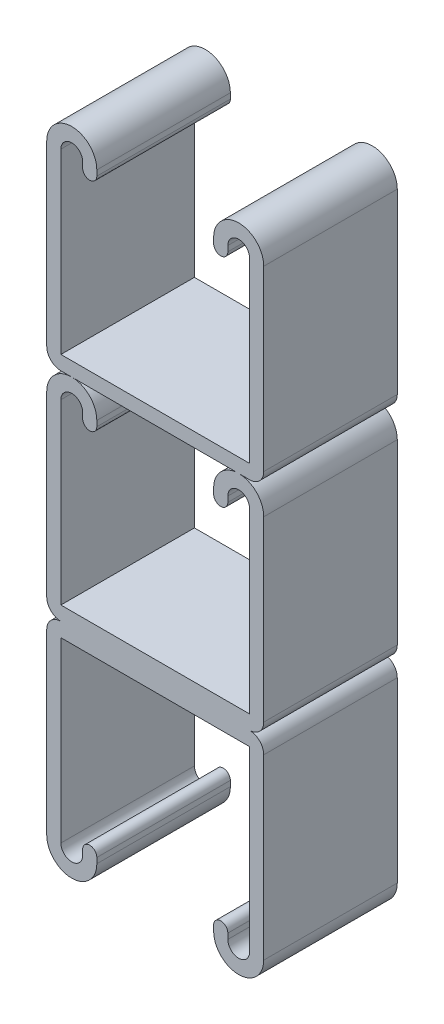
ISO-10303-21;
HEADER;
FILE_DESCRIPTION(('STEP AP214'),'2;1');
FILE_NAME('part.step','',(''),(''),'','','');
FILE_SCHEMA(('AUTOMOTIVE_DESIGN { 1 0 10303 214 1 1 1 1 }'));
ENDSEC;
DATA;
#1=APPLICATION_CONTEXT('core data for automotive mechanical design processes');
#2=APPLICATION_PROTOCOL_DEFINITION('international standard','automotive_design',2000,#1);
#3=PRODUCT_CONTEXT('',#1,'mechanical');
#4=PRODUCT('Part','Part','',(#3));
#5=PRODUCT_RELATED_PRODUCT_CATEGORY('part','',(#4));
#6=PRODUCT_DEFINITION_FORMATION('','',#4);
#7=PRODUCT_DEFINITION_CONTEXT('part definition',#1,'design');
#8=PRODUCT_DEFINITION('design','',#6,#7);
#9=PRODUCT_DEFINITION_SHAPE('','',#8);
#10=(LENGTH_UNIT() NAMED_UNIT(*) SI_UNIT(.MILLI.,.METRE.));
#11=(NAMED_UNIT(*) PLANE_ANGLE_UNIT() SI_UNIT($,.RADIAN.));
#12=(NAMED_UNIT(*) SI_UNIT($,.STERADIAN.) SOLID_ANGLE_UNIT());
#13=UNCERTAINTY_MEASURE_WITH_UNIT(LENGTH_MEASURE(1.E-05),#10,'distance_accuracy_value','');
#14=(GEOMETRIC_REPRESENTATION_CONTEXT(3) GLOBAL_UNCERTAINTY_ASSIGNED_CONTEXT((#13)) GLOBAL_UNIT_ASSIGNED_CONTEXT((#10,
#11,#12)) REPRESENTATION_CONTEXT('',''));
#15=CARTESIAN_POINT('',(0.,0.,0.));
#16=DIRECTION('',(0.,0.,1.));
#17=DIRECTION('',(1.,0.,0.));
#18=AXIS2_PLACEMENT_3D('',#15,#16,#17);
#19=CARTESIAN_POINT('',(-15.875,36.5125,12.7));
#20=DIRECTION('',(0.,0.,-1.));
#21=DIRECTION('',(-1.,0.,0.));
#22=AXIS2_PLACEMENT_3D('',#19,#20,#21);
#23=CYLINDRICAL_SURFACE('',#22,4.7625);
#24=DIRECTION('',(0.,0.,-1.));
#25=VECTOR('',#24,1.);
#26=CARTESIAN_POINT('',(-15.719478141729,41.27246,12.7));
#27=LINE('',#26,#25);
#28=CARTESIAN_POINT('',(-15.719478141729,41.27246,12.7));
#29=VERTEX_POINT('',#28);
#30=CARTESIAN_POINT('',(-15.719478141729,41.27246,-12.7));
#31=VERTEX_POINT('',#30);
#32=EDGE_CURVE('E431',#29,#31,#27,.T.);
#33=ORIENTED_EDGE('',*,*,#32,.F.);
#34=CARTESIAN_POINT('',(-15.875,36.5125,12.7));
#35=DIRECTION('',(0.,0.,1.));
#36=DIRECTION('',(-1.,0.,0.));
#37=AXIS2_PLACEMENT_3D('',#34,#35,#36);
#38=CIRCLE('',#37,4.7625);
#39=CARTESIAN_POINT('',(-11.1125,36.5125,12.7));
#40=VERTEX_POINT('',#39);
#41=EDGE_CURVE('E569',#40,#29,#38,.T.);
#42=ORIENTED_EDGE('',*,*,#41,.F.);
#43=DIRECTION('',(0.,0.,-1.));
#44=VECTOR('',#43,1.);
#45=CARTESIAN_POINT('',(-11.1125,36.5125,12.7));
#46=LINE('',#45,#44);
#47=CARTESIAN_POINT('',(-11.1125,36.5125,-12.7));
#48=VERTEX_POINT('',#47);
#49=EDGE_CURVE('E605',#40,#48,#46,.T.);
#50=ORIENTED_EDGE('',*,*,#49,.T.);
#51=CARTESIAN_POINT('',(-15.875,36.5125,-12.7));
#52=DIRECTION('',(0.,0.,1.));
#53=DIRECTION('',(-1.,0.,0.));
#54=AXIS2_PLACEMENT_3D('',#51,#52,#53);
#55=CIRCLE('',#54,4.7625);
#56=EDGE_CURVE('E606',#48,#31,#55,.T.);
#57=ORIENTED_EDGE('',*,*,#56,.T.);
#58=EDGE_LOOP('',(#33,#42,#50,#57));
#59=FACE_BOUND('',#58,.T.);
#60=ADVANCED_FACE('F39',(#59),#23,.T.);
#61=DIRECTION('',(0.,0.,-1.));
#62=VECTOR('',#61,1.);
#63=CARTESIAN_POINT('',(-16.030521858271,41.27246,12.7));
#64=LINE('',#63,#62);
#65=CARTESIAN_POINT('',(-16.030521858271,41.27246,-12.7));
#66=VERTEX_POINT('',#65);
#67=CARTESIAN_POINT('',(-16.030521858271,41.27246,12.7));
#68=VERTEX_POINT('',#67);
#69=EDGE_CURVE('E428',#66,#68,#64,.F.);
#70=ORIENTED_EDGE('',*,*,#69,.F.);
#71=CARTESIAN_POINT('',(-20.6375,36.5125,-12.7));
#72=VERTEX_POINT('',#71);
#73=EDGE_CURVE('E568',#66,#72,#55,.T.);
#74=ORIENTED_EDGE('',*,*,#73,.T.);
#75=DIRECTION('',(0.,0.,-1.));
#76=VECTOR('',#75,1.);
#77=CARTESIAN_POINT('',(-20.6375,36.5125,12.7));
#78=LINE('',#77,#76);
#79=CARTESIAN_POINT('',(-20.6375,36.5125,12.7));
#80=VERTEX_POINT('',#79);
#81=EDGE_CURVE('E11',#80,#72,#78,.T.);
#82=ORIENTED_EDGE('',*,*,#81,.F.);
#83=EDGE_CURVE('E573',#68,#80,#38,.T.);
#84=ORIENTED_EDGE('',*,*,#83,.F.);
#85=EDGE_LOOP('',(#70,#74,#82,#84));
#86=FACE_BOUND('',#85,.T.);
#87=ADVANCED_FACE('F911',(#86),#23,.T.);
#88=CARTESIAN_POINT('',(15.875,36.5125,12.7));
#89=DIRECTION('',(0.,0.,-1.));
#90=DIRECTION('',(-1.,0.,0.));
#91=AXIS2_PLACEMENT_3D('',#88,#89,#90);
#92=CYLINDRICAL_SURFACE('',#91,4.7625);
#93=DIRECTION('',(0.,0.,-1.));
#94=VECTOR('',#93,1.);
#95=CARTESIAN_POINT('',(16.0305218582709,41.27246,12.7));
#96=LINE('',#95,#94);
#97=CARTESIAN_POINT('',(16.0305218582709,41.27246,12.7));
#98=VERTEX_POINT('',#97);
#99=CARTESIAN_POINT('',(16.0305218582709,41.27246,-12.7));
#100=VERTEX_POINT('',#99);
#101=EDGE_CURVE('E61',#98,#100,#96,.T.);
#102=ORIENTED_EDGE('',*,*,#101,.F.);
#103=CARTESIAN_POINT('',(15.875,36.5125,12.7));
#104=DIRECTION('',(0.,0.,1.));
#105=DIRECTION('',(1.,0.,0.));
#106=AXIS2_PLACEMENT_3D('',#103,#104,#105);
#107=CIRCLE('',#106,4.7625);
#108=CARTESIAN_POINT('',(20.6375,36.5125,12.7));
#109=VERTEX_POINT('',#108);
#110=EDGE_CURVE('E581',#109,#98,#107,.T.);
#111=ORIENTED_EDGE('',*,*,#110,.F.);
#112=DIRECTION('',(0.,0.,-1.));
#113=VECTOR('',#112,1.);
#114=CARTESIAN_POINT('',(20.6375,36.5125,12.7));
#115=LINE('',#114,#113);
#116=CARTESIAN_POINT('',(20.6375,36.5125,-12.7));
#117=VERTEX_POINT('',#116);
#118=EDGE_CURVE('E676',#109,#117,#115,.T.);
#119=ORIENTED_EDGE('',*,*,#118,.T.);
#120=CARTESIAN_POINT('',(15.875,36.5125,-12.7));
#121=DIRECTION('',(0.,0.,1.));
#122=DIRECTION('',(1.,0.,0.));
#123=AXIS2_PLACEMENT_3D('',#120,#121,#122);
#124=CIRCLE('',#123,4.7625);
#125=EDGE_CURVE('E617',#117,#100,#124,.T.);
#126=ORIENTED_EDGE('',*,*,#125,.T.);
#127=EDGE_LOOP('',(#102,#111,#119,#126));
#128=FACE_BOUND('',#127,.T.);
#129=ADVANCED_FACE('F778',(#128),#92,.T.);
#130=DIRECTION('',(0.,0.,-1.));
#131=VECTOR('',#130,1.);
#132=CARTESIAN_POINT('',(15.7194781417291,41.27246,12.7));
#133=LINE('',#132,#131);
#134=CARTESIAN_POINT('',(15.7194781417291,41.27246,-12.7));
#135=VERTEX_POINT('',#134);
#136=CARTESIAN_POINT('',(15.7194781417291,41.27246,12.7));
#137=VERTEX_POINT('',#136);
#138=EDGE_CURVE('E420',#135,#137,#133,.F.);
#139=ORIENTED_EDGE('',*,*,#138,.F.);
#140=CARTESIAN_POINT('',(11.1125,36.5125,-12.7));
#141=VERTEX_POINT('',#140);
#142=EDGE_CURVE('E616',#135,#141,#124,.T.);
#143=ORIENTED_EDGE('',*,*,#142,.T.);
#144=DIRECTION('',(0.,0.,-1.));
#145=VECTOR('',#144,1.);
#146=CARTESIAN_POINT('',(11.1125,36.5125,12.7));
#147=LINE('',#146,#145);
#148=CARTESIAN_POINT('',(11.1125,36.5125,12.7));
#149=VERTEX_POINT('',#148);
#150=EDGE_CURVE('E673',#149,#141,#147,.T.);
#151=ORIENTED_EDGE('',*,*,#150,.F.);
#152=EDGE_CURVE('E53',#137,#149,#107,.T.);
#153=ORIENTED_EDGE('',*,*,#152,.F.);
#154=EDGE_LOOP('',(#139,#143,#151,#153));
#155=FACE_BOUND('',#154,.T.);
#156=ADVANCED_FACE('F914',(#155),#92,.T.);
#157=CARTESIAN_POINT('',(-20.6375,36.5125,12.7));
#158=DIRECTION('',(1.,0.,0.));
#159=DIRECTION('',(0.,1.,0.));
#160=AXIS2_PLACEMENT_3D('',#157,#158,#159);
#161=PLANE('',#160);
#162=DIRECTION('',(0.,-1.,0.));
#163=VECTOR('',#162,1.);
#164=CARTESIAN_POINT('',(-20.6375,36.5125,-12.7));
#165=LINE('',#164,#163);
#166=CARTESIAN_POINT('',(-20.6375,2.6924,-12.7));
#167=VERTEX_POINT('',#166);
#168=EDGE_CURVE('E608',#72,#167,#165,.T.);
#169=ORIENTED_EDGE('',*,*,#168,.T.);
#170=DIRECTION('',(0.,0.,-1.));
#171=VECTOR('',#170,1.);
#172=CARTESIAN_POINT('',(-20.6375,2.6924,12.7));
#173=LINE('',#172,#171);
#174=CARTESIAN_POINT('',(-20.6375,2.6924,12.7));
#175=VERTEX_POINT('',#174);
#176=EDGE_CURVE('E46',#175,#167,#173,.T.);
#177=ORIENTED_EDGE('',*,*,#176,.F.);
#178=DIRECTION('',(0.,-1.,0.));
#179=VECTOR('',#178,1.);
#180=CARTESIAN_POINT('',(-20.6375,36.5125,12.7));
#181=LINE('',#180,#179);
#182=EDGE_CURVE('E572',#80,#175,#181,.T.);
#183=ORIENTED_EDGE('',*,*,#182,.F.);
#184=ORIENTED_EDGE('',*,*,#81,.T.);
#185=EDGE_LOOP('',(#169,#177,#183,#184));
#186=FACE_BOUND('',#185,.T.);
#187=ADVANCED_FACE('F912',(#186),#161,.F.);
#188=CARTESIAN_POINT('',(-17.9451,2.6924,12.7));
#189=DIRECTION('',(0.,0.,-1.));
#190=DIRECTION('',(-1.,0.,0.));
#191=AXIS2_PLACEMENT_3D('',#188,#189,#190);
#192=CYLINDRICAL_SURFACE('',#191,2.6924);
#193=CARTESIAN_POINT('',(-17.9451,2.6924,-12.7));
#194=DIRECTION('',(0.,0.,1.));
#195=DIRECTION('',(-1.,0.,0.));
#196=AXIS2_PLACEMENT_3D('',#193,#194,#195);
#197=CIRCLE('',#196,2.6924);
#198=CARTESIAN_POINT('',(-17.9451,0.,-12.7));
#199=VERTEX_POINT('',#198);
#200=EDGE_CURVE('E610',#167,#199,#197,.T.);
#201=ORIENTED_EDGE('',*,*,#200,.T.);
#202=DIRECTION('',(0.,0.,-1.));
#203=VECTOR('',#202,1.);
#204=CARTESIAN_POINT('',(-17.9451,0.,12.7));
#205=LINE('',#204,#203);
#206=CARTESIAN_POINT('',(-17.9451,0.,12.7));
#207=VERTEX_POINT('',#206);
#208=EDGE_CURVE('E685',#207,#199,#205,.T.);
#209=ORIENTED_EDGE('',*,*,#208,.F.);
#210=CARTESIAN_POINT('',(-17.9451,2.6924,12.7));
#211=DIRECTION('',(0.,0.,1.));
#212=DIRECTION('',(-1.,0.,0.));
#213=AXIS2_PLACEMENT_3D('',#210,#211,#212);
#214=CIRCLE('',#213,2.6924);
#215=EDGE_CURVE('E575',#175,#207,#214,.T.);
#216=ORIENTED_EDGE('',*,*,#215,.F.);
#217=ORIENTED_EDGE('',*,*,#176,.T.);
#218=EDGE_LOOP('',(#201,#209,#216,#217));
#219=FACE_BOUND('',#218,.T.);
#220=ADVANCED_FACE('F692',(#219),#192,.T.);
#221=CARTESIAN_POINT('',(17.9451,2.6924,12.7));
#222=DIRECTION('',(0.,0.,-1.));
#223=DIRECTION('',(-1.,0.,0.));
#224=AXIS2_PLACEMENT_3D('',#221,#222,#223);
#225=CYLINDRICAL_SURFACE('',#224,2.6924);
#226=CARTESIAN_POINT('',(17.9451,2.6924,-12.7));
#227=DIRECTION('',(0.,0.,1.));
#228=DIRECTION('',(1.,0.,0.));
#229=AXIS2_PLACEMENT_3D('',#226,#227,#228);
#230=CIRCLE('',#229,2.6924);
#231=CARTESIAN_POINT('',(17.9451,0.,-12.7));
#232=VERTEX_POINT('',#231);
#233=CARTESIAN_POINT('',(20.6375,2.6924,-12.7));
#234=VERTEX_POINT('',#233);
#235=EDGE_CURVE('E612',#232,#234,#230,.T.);
#236=ORIENTED_EDGE('',*,*,#235,.T.);
#237=DIRECTION('',(0.,0.,-1.));
#238=VECTOR('',#237,1.);
#239=CARTESIAN_POINT('',(20.6375,2.6924,12.7));
#240=LINE('',#239,#238);
#241=CARTESIAN_POINT('',(20.6375,2.6924,12.7));
#242=VERTEX_POINT('',#241);
#243=EDGE_CURVE('E679',#242,#234,#240,.T.);
#244=ORIENTED_EDGE('',*,*,#243,.F.);
#245=CARTESIAN_POINT('',(17.9451,2.6924,12.7));
#246=DIRECTION('',(0.,0.,1.));
#247=DIRECTION('',(1.,0.,0.));
#248=AXIS2_PLACEMENT_3D('',#245,#246,#247);
#249=CIRCLE('',#248,2.6924);
#250=CARTESIAN_POINT('',(17.9451,0.,12.7));
#251=VERTEX_POINT('',#250);
#252=EDGE_CURVE('E577',#251,#242,#249,.T.);
#253=ORIENTED_EDGE('',*,*,#252,.F.);
#254=DIRECTION('',(0.,0.,-1.));
#255=VECTOR('',#254,1.);
#256=CARTESIAN_POINT('',(17.9451,0.,12.7));
#257=LINE('',#256,#255);
#258=EDGE_CURVE('E682',#251,#232,#257,.T.);
#259=ORIENTED_EDGE('',*,*,#258,.T.);
#260=EDGE_LOOP('',(#236,#244,#253,#259));
#261=FACE_BOUND('',#260,.T.);
#262=ADVANCED_FACE('F773',(#261),#225,.T.);
#263=CARTESIAN_POINT('',(20.6375,2.6924,12.7));
#264=DIRECTION('',(-1.,0.,0.));
#265=DIRECTION('',(0.,0.,1.));
#266=AXIS2_PLACEMENT_3D('',#263,#264,#265);
#267=PLANE('',#266);
#268=DIRECTION('',(0.,1.,0.));
#269=VECTOR('',#268,1.);
#270=CARTESIAN_POINT('',(20.6375,2.6924,-12.7));
#271=LINE('',#270,#269);
#272=EDGE_CURVE('E614',#234,#117,#271,.T.);
#273=ORIENTED_EDGE('',*,*,#272,.T.);
#274=ORIENTED_EDGE('',*,*,#118,.F.);
#275=DIRECTION('',(0.,1.,0.));
#276=VECTOR('',#275,1.);
#277=CARTESIAN_POINT('',(20.6375,2.6924,12.7));
#278=LINE('',#277,#276);
#279=EDGE_CURVE('E579',#242,#109,#278,.T.);
#280=ORIENTED_EDGE('',*,*,#279,.F.);
#281=ORIENTED_EDGE('',*,*,#243,.T.);
#282=EDGE_LOOP('',(#273,#274,#280,#281));
#283=FACE_BOUND('',#282,.T.);
#284=ADVANCED_FACE('F776',(#283),#267,.F.);
#285=CARTESIAN_POINT('',(11.1125,36.5125,12.7));
#286=DIRECTION('',(1.,0.,0.));
#287=DIRECTION('',(0.,1.,0.));
#288=AXIS2_PLACEMENT_3D('',#285,#286,#287);
#289=PLANE('',#288);
#290=DIRECTION('',(0.,-1.,0.));
#291=VECTOR('',#290,1.);
#292=CARTESIAN_POINT('',(11.1125,36.5125,-12.7));
#293=LINE('',#292,#291);
#294=CARTESIAN_POINT('',(11.1125,35.47745,-12.7));
#295=VERTEX_POINT('',#294);
#296=EDGE_CURVE('E619',#141,#295,#293,.T.);
#297=ORIENTED_EDGE('',*,*,#296,.T.);
#298=DIRECTION('',(0.,0.,-1.));
#299=VECTOR('',#298,1.);
#300=CARTESIAN_POINT('',(11.1125,35.47745,12.7));
#301=LINE('',#300,#299);
#302=CARTESIAN_POINT('',(11.1125,35.47745,12.7));
#303=VERTEX_POINT('',#302);
#304=EDGE_CURVE('E670',#303,#295,#301,.T.);
#305=ORIENTED_EDGE('',*,*,#304,.F.);
#306=DIRECTION('',(0.,-1.,0.));
#307=VECTOR('',#306,1.);
#308=CARTESIAN_POINT('',(11.1125,36.5125,12.7));
#309=LINE('',#308,#307);
#310=EDGE_CURVE('E583',#149,#303,#309,.T.);
#311=ORIENTED_EDGE('',*,*,#310,.F.);
#312=ORIENTED_EDGE('',*,*,#150,.T.);
#313=EDGE_LOOP('',(#297,#305,#311,#312));
#314=FACE_BOUND('',#313,.T.);
#315=ADVANCED_FACE('F940',(#314),#289,.F.);
#316=CARTESIAN_POINT('',(12.4587,35.47745,12.7));
#317=DIRECTION('',(0.,0.,-1.));
#318=DIRECTION('',(-1.,0.,0.));
#319=AXIS2_PLACEMENT_3D('',#316,#317,#318);
#320=CYLINDRICAL_SURFACE('',#319,1.3462);
#321=CARTESIAN_POINT('',(12.4587,35.47745,-12.7));
#322=DIRECTION('',(0.,0.,1.));
#323=DIRECTION('',(1.,0.,0.));
#324=AXIS2_PLACEMENT_3D('',#321,#322,#323);
#325=CIRCLE('',#324,1.3462);
#326=CARTESIAN_POINT('',(13.8049,35.47745,-12.7));
#327=VERTEX_POINT('',#326);
#328=EDGE_CURVE('E621',#295,#327,#325,.T.);
#329=ORIENTED_EDGE('',*,*,#328,.T.);
#330=DIRECTION('',(0.,0.,-1.));
#331=VECTOR('',#330,1.);
#332=CARTESIAN_POINT('',(13.8049,35.47745,12.7));
#333=LINE('',#332,#331);
#334=CARTESIAN_POINT('',(13.8049,35.47745,12.7));
#335=VERTEX_POINT('',#334);
#336=EDGE_CURVE('E667',#335,#327,#333,.T.);
#337=ORIENTED_EDGE('',*,*,#336,.F.);
#338=CARTESIAN_POINT('',(12.4587,35.47745,12.7));
#339=DIRECTION('',(0.,0.,1.));
#340=DIRECTION('',(1.,0.,0.));
#341=AXIS2_PLACEMENT_3D('',#338,#339,#340);
#342=CIRCLE('',#341,1.3462);
#343=EDGE_CURVE('E585',#303,#335,#342,.T.);
#344=ORIENTED_EDGE('',*,*,#343,.F.);
#345=ORIENTED_EDGE('',*,*,#304,.T.);
#346=EDGE_LOOP('',(#329,#337,#344,#345));
#347=FACE_BOUND('',#346,.T.);
#348=ADVANCED_FACE('F947',(#347),#320,.T.);
#349=CARTESIAN_POINT('',(13.8049,36.5125,12.7));
#350=DIRECTION('',(-1.,0.,0.));
#351=DIRECTION('',(0.,0.,1.));
#352=AXIS2_PLACEMENT_3D('',#349,#350,#351);
#353=PLANE('',#352);
#354=DIRECTION('',(0.,1.,0.));
#355=VECTOR('',#354,1.);
#356=CARTESIAN_POINT('',(13.8049,36.5125,-12.7));
#357=LINE('',#356,#355);
#358=CARTESIAN_POINT('',(13.8049,36.5125,-12.7));
#359=VERTEX_POINT('',#358);
#360=EDGE_CURVE('E623',#327,#359,#357,.T.);
#361=ORIENTED_EDGE('',*,*,#360,.T.);
#362=DIRECTION('',(0.,0.,-1.));
#363=VECTOR('',#362,1.);
#364=CARTESIAN_POINT('',(13.8049,36.5125,12.7));
#365=LINE('',#364,#363);
#366=CARTESIAN_POINT('',(13.8049,36.5125,12.7));
#367=VERTEX_POINT('',#366);
#368=EDGE_CURVE('E664',#367,#359,#365,.T.);
#369=ORIENTED_EDGE('',*,*,#368,.F.);
#370=DIRECTION('',(0.,1.,0.));
#371=VECTOR('',#370,1.);
#372=CARTESIAN_POINT('',(13.8049,36.5125,12.7));
#373=LINE('',#372,#371);
#374=EDGE_CURVE('E587',#335,#367,#373,.T.);
#375=ORIENTED_EDGE('',*,*,#374,.F.);
#376=ORIENTED_EDGE('',*,*,#336,.T.);
#377=EDGE_LOOP('',(#361,#369,#375,#376));
#378=FACE_BOUND('',#377,.T.);
#379=ADVANCED_FACE('F951',(#378),#353,.F.);
#380=CARTESIAN_POINT('',(15.875,36.5125,12.7));
#381=DIRECTION('',(0.,0.,-1.));
#382=DIRECTION('',(-1.,0.,0.));
#383=AXIS2_PLACEMENT_3D('',#380,#381,#382);
#384=CYLINDRICAL_SURFACE('',#383,2.0701);
#385=CARTESIAN_POINT('',(15.875,36.5125,-12.7));
#386=DIRECTION('',(0.,0.,-1.));
#387=DIRECTION('',(1.,0.,0.));
#388=AXIS2_PLACEMENT_3D('',#385,#386,#387);
#389=CIRCLE('',#388,2.0701);
#390=CARTESIAN_POINT('',(17.9451,36.5125,-12.7));
#391=VERTEX_POINT('',#390);
#392=EDGE_CURVE('E625',#359,#391,#389,.T.);
#393=ORIENTED_EDGE('',*,*,#392,.T.);
#394=DIRECTION('',(0.,0.,-1.));
#395=VECTOR('',#394,1.);
#396=CARTESIAN_POINT('',(17.9451,36.5125,12.7));
#397=LINE('',#396,#395);
#398=CARTESIAN_POINT('',(17.9451,36.5125,12.7));
#399=VERTEX_POINT('',#398);
#400=EDGE_CURVE('E661',#399,#391,#397,.T.);
#401=ORIENTED_EDGE('',*,*,#400,.F.);
#402=CARTESIAN_POINT('',(15.875,36.5125,12.7));
#403=DIRECTION('',(0.,0.,-1.));
#404=DIRECTION('',(1.,0.,0.));
#405=AXIS2_PLACEMENT_3D('',#402,#403,#404);
#406=CIRCLE('',#405,2.0701);
#407=EDGE_CURVE('E589',#367,#399,#406,.T.);
#408=ORIENTED_EDGE('',*,*,#407,.F.);
#409=ORIENTED_EDGE('',*,*,#368,.T.);
#410=EDGE_LOOP('',(#393,#401,#408,#409));
#411=FACE_BOUND('',#410,.T.);
#412=ADVANCED_FACE('F958',(#411),#384,.F.);
#413=CARTESIAN_POINT('',(17.9451,2.6924,12.7));
#414=DIRECTION('',(1.,0.,0.));
#415=DIRECTION('',(0.,1.,0.));
#416=AXIS2_PLACEMENT_3D('',#413,#414,#415);
#417=PLANE('',#416);
#418=DIRECTION('',(0.,-1.,0.));
#419=VECTOR('',#418,1.);
#420=CARTESIAN_POINT('',(17.9451,2.6924,-12.7));
#421=LINE('',#420,#419);
#422=CARTESIAN_POINT('',(17.9451,2.6924,-12.7));
#423=VERTEX_POINT('',#422);
#424=EDGE_CURVE('E627',#391,#423,#421,.T.);
#425=ORIENTED_EDGE('',*,*,#424,.T.);
#426=DIRECTION('',(0.,0.,-1.));
#427=VECTOR('',#426,1.);
#428=CARTESIAN_POINT('',(17.9451,2.6924,12.7));
#429=LINE('',#428,#427);
#430=CARTESIAN_POINT('',(17.9451,2.6924,12.7));
#431=VERTEX_POINT('',#430);
#432=EDGE_CURVE('E658',#431,#423,#429,.T.);
#433=ORIENTED_EDGE('',*,*,#432,.F.);
#434=DIRECTION('',(0.,-1.,0.));
#435=VECTOR('',#434,1.);
#436=CARTESIAN_POINT('',(17.9451,2.6924,12.7));
#437=LINE('',#436,#435);
#438=EDGE_CURVE('E591',#399,#431,#437,.T.);
#439=ORIENTED_EDGE('',*,*,#438,.F.);
#440=ORIENTED_EDGE('',*,*,#400,.T.);
#441=EDGE_LOOP('',(#425,#433,#439,#440));
#442=FACE_BOUND('',#441,.T.);
#443=ADVANCED_FACE('F961',(#442),#417,.F.);
#444=CARTESIAN_POINT('',(-17.9451,2.6924,12.7));
#445=DIRECTION('',(0.,-1.,0.));
#446=DIRECTION('',(1.,0.,0.));
#447=AXIS2_PLACEMENT_3D('',#444,#445,#446);
#448=PLANE('',#447);
#449=DIRECTION('',(-1.,0.,0.));
#450=VECTOR('',#449,1.);
#451=CARTESIAN_POINT('',(-17.9451,2.6924,-12.7));
#452=LINE('',#451,#450);
#453=CARTESIAN_POINT('',(-17.9451,2.6924,-12.7));
#454=VERTEX_POINT('',#453);
#455=EDGE_CURVE('E629',#423,#454,#452,.T.);
#456=ORIENTED_EDGE('',*,*,#455,.T.);
#457=DIRECTION('',(0.,0.,-1.));
#458=VECTOR('',#457,1.);
#459=CARTESIAN_POINT('',(-17.9451,2.6924,12.7));
#460=LINE('',#459,#458);
#461=CARTESIAN_POINT('',(-17.9451,2.6924,12.7));
#462=VERTEX_POINT('',#461);
#463=EDGE_CURVE('E655',#462,#454,#460,.T.);
#464=ORIENTED_EDGE('',*,*,#463,.F.);
#465=DIRECTION('',(-1.,0.,0.));
#466=VECTOR('',#465,1.);
#467=CARTESIAN_POINT('',(-17.9451,2.6924,12.7));
#468=LINE('',#467,#466);
#469=EDGE_CURVE('E593',#431,#462,#468,.T.);
#470=ORIENTED_EDGE('',*,*,#469,.F.);
#471=ORIENTED_EDGE('',*,*,#432,.T.);
#472=EDGE_LOOP('',(#456,#464,#470,#471));
#473=FACE_BOUND('',#472,.T.);
#474=ADVANCED_FACE('F966',(#473),#448,.F.);
#475=CARTESIAN_POINT('',(-17.9451,36.5125,12.7));
#476=DIRECTION('',(-1.,0.,0.));
#477=DIRECTION('',(0.,-1.,0.));
#478=AXIS2_PLACEMENT_3D('',#475,#476,#477);
#479=PLANE('',#478);
#480=DIRECTION('',(0.,1.,0.));
#481=VECTOR('',#480,1.);
#482=CARTESIAN_POINT('',(-17.9451,36.5125,-12.7));
#483=LINE('',#482,#481);
#484=CARTESIAN_POINT('',(-17.9451,36.5125,-12.7));
#485=VERTEX_POINT('',#484);
#486=EDGE_CURVE('E631',#454,#485,#483,.T.);
#487=ORIENTED_EDGE('',*,*,#486,.T.);
#488=DIRECTION('',(0.,0.,-1.));
#489=VECTOR('',#488,1.);
#490=CARTESIAN_POINT('',(-17.9451,36.5125,12.7));
#491=LINE('',#490,#489);
#492=CARTESIAN_POINT('',(-17.9451,36.5125,12.7));
#493=VERTEX_POINT('',#492);
#494=EDGE_CURVE('E652',#493,#485,#491,.T.);
#495=ORIENTED_EDGE('',*,*,#494,.F.);
#496=DIRECTION('',(0.,1.,0.));
#497=VECTOR('',#496,1.);
#498=CARTESIAN_POINT('',(-17.9451,36.5125,12.7));
#499=LINE('',#498,#497);
#500=EDGE_CURVE('E595',#462,#493,#499,.T.);
#501=ORIENTED_EDGE('',*,*,#500,.F.);
#502=ORIENTED_EDGE('',*,*,#463,.T.);
#503=EDGE_LOOP('',(#487,#495,#501,#502));
#504=FACE_BOUND('',#503,.T.);
#505=ADVANCED_FACE('F972',(#504),#479,.F.);
#506=CARTESIAN_POINT('',(-15.875,36.5125,12.7));
#507=DIRECTION('',(0.,0.,-1.));
#508=DIRECTION('',(-1.,0.,0.));
#509=AXIS2_PLACEMENT_3D('',#506,#507,#508);
#510=CYLINDRICAL_SURFACE('',#509,2.0701);
#511=CARTESIAN_POINT('',(-15.875,36.5125,-12.7));
#512=DIRECTION('',(0.,0.,-1.));
#513=DIRECTION('',(-1.,0.,0.));
#514=AXIS2_PLACEMENT_3D('',#511,#512,#513);
#515=CIRCLE('',#514,2.0701);
#516=CARTESIAN_POINT('',(-13.8049,36.5125,-12.7));
#517=VERTEX_POINT('',#516);
#518=EDGE_CURVE('E633',#485,#517,#515,.T.);
#519=ORIENTED_EDGE('',*,*,#518,.T.);
#520=DIRECTION('',(0.,0.,-1.));
#521=VECTOR('',#520,1.);
#522=CARTESIAN_POINT('',(-13.8049,36.5125,12.7));
#523=LINE('',#522,#521);
#524=CARTESIAN_POINT('',(-13.8049,36.5125,12.7));
#525=VERTEX_POINT('',#524);
#526=EDGE_CURVE('E649',#525,#517,#523,.T.);
#527=ORIENTED_EDGE('',*,*,#526,.F.);
#528=CARTESIAN_POINT('',(-15.875,36.5125,12.7));
#529=DIRECTION('',(0.,0.,-1.));
#530=DIRECTION('',(-1.,0.,0.));
#531=AXIS2_PLACEMENT_3D('',#528,#529,#530);
#532=CIRCLE('',#531,2.0701);
#533=EDGE_CURVE('E597',#493,#525,#532,.T.);
#534=ORIENTED_EDGE('',*,*,#533,.F.);
#535=ORIENTED_EDGE('',*,*,#494,.T.);
#536=EDGE_LOOP('',(#519,#527,#534,#535));
#537=FACE_BOUND('',#536,.T.);
#538=ADVANCED_FACE('F976',(#537),#510,.F.);
#539=CARTESIAN_POINT('',(-13.8049,36.5125,12.7));
#540=DIRECTION('',(1.,0.,0.));
#541=DIRECTION('',(0.,1.,0.));
#542=AXIS2_PLACEMENT_3D('',#539,#540,#541);
#543=PLANE('',#542);
#544=DIRECTION('',(0.,-1.,0.));
#545=VECTOR('',#544,1.);
#546=CARTESIAN_POINT('',(-13.8049,36.5125,-12.7));
#547=LINE('',#546,#545);
#548=CARTESIAN_POINT('',(-13.8049,35.47745,-12.7));
#549=VERTEX_POINT('',#548);
#550=EDGE_CURVE('E635',#517,#549,#547,.T.);
#551=ORIENTED_EDGE('',*,*,#550,.T.);
#552=DIRECTION('',(0.,0.,-1.));
#553=VECTOR('',#552,1.);
#554=CARTESIAN_POINT('',(-13.8049,35.47745,12.7));
#555=LINE('',#554,#553);
#556=CARTESIAN_POINT('',(-13.8049,35.47745,12.7));
#557=VERTEX_POINT('',#556);
#558=EDGE_CURVE('E646',#557,#549,#555,.T.);
#559=ORIENTED_EDGE('',*,*,#558,.F.);
#560=DIRECTION('',(0.,-1.,0.));
#561=VECTOR('',#560,1.);
#562=CARTESIAN_POINT('',(-13.8049,36.5125,12.7));
#563=LINE('',#562,#561);
#564=EDGE_CURVE('E599',#525,#557,#563,.T.);
#565=ORIENTED_EDGE('',*,*,#564,.F.);
#566=ORIENTED_EDGE('',*,*,#526,.T.);
#567=EDGE_LOOP('',(#551,#559,#565,#566));
#568=FACE_BOUND('',#567,.T.);
#569=ADVANCED_FACE('F981',(#568),#543,.F.);
#570=CARTESIAN_POINT('',(-12.4587,35.47745,12.7));
#571=DIRECTION('',(0.,0.,-1.));
#572=DIRECTION('',(-1.,0.,0.));
#573=AXIS2_PLACEMENT_3D('',#570,#571,#572);
#574=CYLINDRICAL_SURFACE('',#573,1.3462);
#575=CARTESIAN_POINT('',(-12.4587,35.47745,-12.7));
#576=DIRECTION('',(0.,0.,1.));
#577=DIRECTION('',(-1.,0.,0.));
#578=AXIS2_PLACEMENT_3D('',#575,#576,#577);
#579=CIRCLE('',#578,1.3462);
#580=CARTESIAN_POINT('',(-11.1125,35.47745,-12.7));
#581=VERTEX_POINT('',#580);
#582=EDGE_CURVE('E637',#549,#581,#579,.T.);
#583=ORIENTED_EDGE('',*,*,#582,.T.);
#584=DIRECTION('',(0.,0.,-1.));
#585=VECTOR('',#584,1.);
#586=CARTESIAN_POINT('',(-11.1125,35.47745,12.7));
#587=LINE('',#586,#585);
#588=CARTESIAN_POINT('',(-11.1125,35.47745,12.7));
#589=VERTEX_POINT('',#588);
#590=EDGE_CURVE('E643',#589,#581,#587,.T.);
#591=ORIENTED_EDGE('',*,*,#590,.F.);
#592=CARTESIAN_POINT('',(-12.4587,35.47745,12.7));
#593=DIRECTION('',(0.,0.,1.));
#594=DIRECTION('',(-1.,0.,0.));
#595=AXIS2_PLACEMENT_3D('',#592,#593,#594);
#596=CIRCLE('',#595,1.3462);
#597=EDGE_CURVE('E601',#557,#589,#596,.T.);
#598=ORIENTED_EDGE('',*,*,#597,.F.);
#599=ORIENTED_EDGE('',*,*,#558,.T.);
#600=EDGE_LOOP('',(#583,#591,#598,#599));
#601=FACE_BOUND('',#600,.T.);
#602=ADVANCED_FACE('F985',(#601),#574,.T.);
#603=CARTESIAN_POINT('',(-11.1125,36.5125,12.7));
#604=DIRECTION('',(-1.,0.,0.));
#605=DIRECTION('',(0.,0.,1.));
#606=AXIS2_PLACEMENT_3D('',#603,#604,#605);
#607=PLANE('',#606);
#608=DIRECTION('',(0.,1.,0.));
#609=VECTOR('',#608,1.);
#610=CARTESIAN_POINT('',(-11.1125,36.5125,-12.7));
#611=LINE('',#610,#609);
#612=EDGE_CURVE('E639',#581,#48,#611,.T.);
#613=ORIENTED_EDGE('',*,*,#612,.T.);
#614=ORIENTED_EDGE('',*,*,#49,.F.);
#615=DIRECTION('',(0.,1.,0.));
#616=VECTOR('',#615,1.);
#617=CARTESIAN_POINT('',(-11.1125,36.5125,12.7));
#618=LINE('',#617,#616);
#619=EDGE_CURVE('E603',#589,#40,#618,.T.);
#620=ORIENTED_EDGE('',*,*,#619,.F.);
#621=ORIENTED_EDGE('',*,*,#590,.T.);
#622=EDGE_LOOP('',(#613,#614,#620,#621));
#623=FACE_BOUND('',#622,.T.);
#624=ADVANCED_FACE('F989',(#623),#607,.F.);
#625=CARTESIAN_POINT('',(-15.875,36.5125,12.7));
#626=DIRECTION('',(0.,0.,-1.));
#627=DIRECTION('',(-1.,0.,0.));
#628=AXIS2_PLACEMENT_3D('',#625,#626,#627);
#629=PLANE('',#628);
#630=DIRECTION('',(1.,0.,0.));
#631=VECTOR('',#630,1.);
#632=CARTESIAN_POINT('',(-17.9451,41.27246,12.7));
#633=LINE('',#632,#631);
#634=CARTESIAN_POINT('',(-17.9451,41.27246,12.7));
#635=VERTEX_POINT('',#634);
#636=EDGE_CURVE('E790',#635,#68,#633,.T.);
#637=ORIENTED_EDGE('',*,*,#636,.T.);
#638=ORIENTED_EDGE('',*,*,#83,.T.);
#639=ORIENTED_EDGE('',*,*,#182,.T.);
#640=ORIENTED_EDGE('',*,*,#215,.T.);
#641=CARTESIAN_POINT('',(-17.9451,-2.6924,12.7));
#642=DIRECTION('',(0.,0.,-1.));
#643=DIRECTION('',(-1.,0.,0.));
#644=AXIS2_PLACEMENT_3D('',#641,#642,#643);
#645=CIRCLE('',#644,2.6924);
#646=CARTESIAN_POINT('',(-20.6375,-2.6924,12.7));
#647=VERTEX_POINT('',#646);
#648=EDGE_CURVE('E481',#647,#207,#645,.T.);
#649=ORIENTED_EDGE('',*,*,#648,.F.);
#650=DIRECTION('',(0.,1.,0.));
#651=VECTOR('',#650,1.);
#652=CARTESIAN_POINT('',(-20.6375,-36.5125,12.7));
#653=LINE('',#652,#651);
#654=CARTESIAN_POINT('',(-20.6375,-36.5125,12.7));
#655=VERTEX_POINT('',#654);
#656=EDGE_CURVE('E484',#655,#647,#653,.T.);
#657=ORIENTED_EDGE('',*,*,#656,.F.);
#658=CARTESIAN_POINT('',(-15.875,-36.5125,12.7));
#659=DIRECTION('',(0.,0.,-1.));
#660=DIRECTION('',(-1.,0.,0.));
#661=AXIS2_PLACEMENT_3D('',#658,#659,#660);
#662=CIRCLE('',#661,4.7625);
#663=CARTESIAN_POINT('',(-11.1125,-36.5125,12.7));
#664=VERTEX_POINT('',#663);
#665=EDGE_CURVE('E435',#664,#655,#662,.T.);
#666=ORIENTED_EDGE('',*,*,#665,.F.);
#667=DIRECTION('',(0.,-1.,0.));
#668=VECTOR('',#667,1.);
#669=CARTESIAN_POINT('',(-11.1125,-36.5125,12.7));
#670=LINE('',#669,#668);
#671=CARTESIAN_POINT('',(-11.1125,-35.47745,12.7));
#672=VERTEX_POINT('',#671);
#673=EDGE_CURVE('E438',#672,#664,#670,.T.);
#674=ORIENTED_EDGE('',*,*,#673,.F.);
#675=CARTESIAN_POINT('',(-12.4587,-35.47745,12.7));
#676=DIRECTION('',(0.,0.,-1.));
#677=DIRECTION('',(-1.,0.,0.));
#678=AXIS2_PLACEMENT_3D('',#675,#676,#677);
#679=CIRCLE('',#678,1.3462);
#680=CARTESIAN_POINT('',(-13.8049,-35.47745,12.7));
#681=VERTEX_POINT('',#680);
#682=EDGE_CURVE('E442',#681,#672,#679,.T.);
#683=ORIENTED_EDGE('',*,*,#682,.F.);
#684=DIRECTION('',(0.,1.,0.));
#685=VECTOR('',#684,1.);
#686=CARTESIAN_POINT('',(-13.8049,-36.5125,12.7));
#687=LINE('',#686,#685);
#688=CARTESIAN_POINT('',(-13.8049,-36.5125,12.7));
#689=VERTEX_POINT('',#688);
#690=EDGE_CURVE('E445',#689,#681,#687,.T.);
#691=ORIENTED_EDGE('',*,*,#690,.F.);
#692=CARTESIAN_POINT('',(-15.875,-36.5125,12.7));
#693=DIRECTION('',(0.,0.,1.));
#694=DIRECTION('',(-1.,0.,0.));
#695=AXIS2_PLACEMENT_3D('',#692,#693,#694);
#696=CIRCLE('',#695,2.0701);
#697=CARTESIAN_POINT('',(-17.9451,-36.5125,12.7));
#698=VERTEX_POINT('',#697);
#699=EDGE_CURVE('E448',#698,#689,#696,.T.);
#700=ORIENTED_EDGE('',*,*,#699,.F.);
#701=DIRECTION('',(0.,-1.,0.));
#702=VECTOR('',#701,1.);
#703=CARTESIAN_POINT('',(-17.9451,-36.5125,12.7));
#704=LINE('',#703,#702);
#705=CARTESIAN_POINT('',(-17.9451,-2.6924,12.7));
#706=VERTEX_POINT('',#705);
#707=EDGE_CURVE('E451',#706,#698,#704,.T.);
#708=ORIENTED_EDGE('',*,*,#707,.F.);
#709=DIRECTION('',(-1.,0.,0.));
#710=VECTOR('',#709,1.);
#711=CARTESIAN_POINT('',(-17.9451,-2.6924,12.7));
#712=LINE('',#711,#710);
#713=CARTESIAN_POINT('',(17.9451,-2.6924,12.7));
#714=VERTEX_POINT('',#713);
#715=EDGE_CURVE('E454',#714,#706,#712,.T.);
#716=ORIENTED_EDGE('',*,*,#715,.F.);
#717=DIRECTION('',(0.,1.,0.));
#718=VECTOR('',#717,1.);
#719=CARTESIAN_POINT('',(17.9451,-2.6924,12.7));
#720=LINE('',#719,#718);
#721=CARTESIAN_POINT('',(17.9451,-36.5125,12.7));
#722=VERTEX_POINT('',#721);
#723=EDGE_CURVE('E457',#722,#714,#720,.T.);
#724=ORIENTED_EDGE('',*,*,#723,.F.);
#725=CARTESIAN_POINT('',(15.875,-36.5125,12.7));
#726=DIRECTION('',(0.,0.,1.));
#727=DIRECTION('',(1.,0.,0.));
#728=AXIS2_PLACEMENT_3D('',#725,#726,#727);
#729=CIRCLE('',#728,2.0701);
#730=CARTESIAN_POINT('',(13.8049,-36.5125,12.7));
#731=VERTEX_POINT('',#730);
#732=EDGE_CURVE('E460',#731,#722,#729,.T.);
#733=ORIENTED_EDGE('',*,*,#732,.F.);
#734=DIRECTION('',(0.,-1.,0.));
#735=VECTOR('',#734,1.);
#736=CARTESIAN_POINT('',(13.8049,-36.5125,12.7));
#737=LINE('',#736,#735);
#738=CARTESIAN_POINT('',(13.8049,-35.47745,12.7));
#739=VERTEX_POINT('',#738);
#740=EDGE_CURVE('E463',#739,#731,#737,.T.);
#741=ORIENTED_EDGE('',*,*,#740,.F.);
#742=CARTESIAN_POINT('',(12.4587,-35.47745,12.7));
#743=DIRECTION('',(0.,0.,-1.));
#744=DIRECTION('',(1.,0.,0.));
#745=AXIS2_PLACEMENT_3D('',#742,#743,#744);
#746=CIRCLE('',#745,1.3462);
#747=CARTESIAN_POINT('',(11.1125,-35.47745,12.7));
#748=VERTEX_POINT('',#747);
#749=EDGE_CURVE('E466',#748,#739,#746,.T.);
#750=ORIENTED_EDGE('',*,*,#749,.F.);
#751=DIRECTION('',(0.,1.,0.));
#752=VECTOR('',#751,1.);
#753=CARTESIAN_POINT('',(11.1125,-36.5125,12.7));
#754=LINE('',#753,#752);
#755=CARTESIAN_POINT('',(11.1125,-36.5125,12.7));
#756=VERTEX_POINT('',#755);
#757=EDGE_CURVE('E469',#756,#748,#754,.T.);
#758=ORIENTED_EDGE('',*,*,#757,.F.);
#759=CARTESIAN_POINT('',(15.875,-36.5125,12.7));
#760=DIRECTION('',(0.,0.,-1.));
#761=DIRECTION('',(1.,0.,0.));
#762=AXIS2_PLACEMENT_3D('',#759,#760,#761);
#763=CIRCLE('',#762,4.7625);
#764=CARTESIAN_POINT('',(20.6375,-36.5125,12.7));
#765=VERTEX_POINT('',#764);
#766=EDGE_CURVE('E472',#765,#756,#763,.T.);
#767=ORIENTED_EDGE('',*,*,#766,.F.);
#768=DIRECTION('',(0.,-1.,0.));
#769=VECTOR('',#768,1.);
#770=CARTESIAN_POINT('',(20.6375,-2.6924,12.7));
#771=LINE('',#770,#769);
#772=CARTESIAN_POINT('',(20.6375,-2.6924,12.7));
#773=VERTEX_POINT('',#772);
#774=EDGE_CURVE('E475',#773,#765,#771,.T.);
#775=ORIENTED_EDGE('',*,*,#774,.F.);
#776=CARTESIAN_POINT('',(17.9451,-2.6924,12.7));
#777=DIRECTION('',(0.,0.,-1.));
#778=DIRECTION('',(1.,0.,0.));
#779=AXIS2_PLACEMENT_3D('',#776,#777,#778);
#780=CIRCLE('',#779,2.6924);
#781=EDGE_CURVE('E478',#251,#773,#780,.T.);
#782=ORIENTED_EDGE('',*,*,#781,.F.);
#783=ORIENTED_EDGE('',*,*,#252,.T.);
#784=ORIENTED_EDGE('',*,*,#279,.T.);
#785=ORIENTED_EDGE('',*,*,#110,.T.);
#786=CARTESIAN_POINT('',(17.9451,41.27246,12.7));
#787=VERTEX_POINT('',#786);
#788=EDGE_CURVE('E780',#98,#787,#633,.T.);
#789=ORIENTED_EDGE('',*,*,#788,.T.);
#790=CARTESIAN_POINT('',(17.9451,43.96486,12.7));
#791=DIRECTION('',(0.,0.,1.));
#792=DIRECTION('',(1.,0.,0.));
#793=AXIS2_PLACEMENT_3D('',#790,#791,#792);
#794=CIRCLE('',#793,2.6924);
#795=CARTESIAN_POINT('',(20.6375,43.96486,12.7));
#796=VERTEX_POINT('',#795);
#797=EDGE_CURVE('E794',#787,#796,#794,.T.);
#798=ORIENTED_EDGE('',*,*,#797,.T.);
#799=DIRECTION('',(0.,1.,0.));
#800=VECTOR('',#799,1.);
#801=CARTESIAN_POINT('',(20.6375,43.96486,12.7));
#802=LINE('',#801,#800);
#803=CARTESIAN_POINT('',(20.6375,77.78496,12.7));
#804=VERTEX_POINT('',#803);
#805=EDGE_CURVE('E796',#796,#804,#802,.T.);
#806=ORIENTED_EDGE('',*,*,#805,.T.);
#807=CARTESIAN_POINT('',(15.875,77.78496,12.7));
#808=DIRECTION('',(0.,0.,1.));
#809=DIRECTION('',(1.,0.,0.));
#810=AXIS2_PLACEMENT_3D('',#807,#808,#809);
#811=CIRCLE('',#810,4.7625);
#812=CARTESIAN_POINT('',(11.1125,77.78496,12.7));
#813=VERTEX_POINT('',#812);
#814=EDGE_CURVE('E798',#804,#813,#811,.T.);
#815=ORIENTED_EDGE('',*,*,#814,.T.);
#816=DIRECTION('',(0.,-1.,0.));
#817=VECTOR('',#816,1.);
#818=CARTESIAN_POINT('',(11.1125,77.78496,12.7));
#819=LINE('',#818,#817);
#820=CARTESIAN_POINT('',(11.1125,76.74991,12.7));
#821=VERTEX_POINT('',#820);
#822=EDGE_CURVE('E802',#813,#821,#819,.T.);
#823=ORIENTED_EDGE('',*,*,#822,.T.);
#824=CARTESIAN_POINT('',(12.4587,76.74991,12.7));
#825=DIRECTION('',(0.,0.,1.));
#826=DIRECTION('',(1.,0.,0.));
#827=AXIS2_PLACEMENT_3D('',#824,#825,#826);
#828=CIRCLE('',#827,1.3462);
#829=CARTESIAN_POINT('',(13.8049,76.74991,12.7));
#830=VERTEX_POINT('',#829);
#831=EDGE_CURVE('E804',#821,#830,#828,.T.);
#832=ORIENTED_EDGE('',*,*,#831,.T.);
#833=DIRECTION('',(0.,1.,0.));
#834=VECTOR('',#833,1.);
#835=CARTESIAN_POINT('',(13.8049,77.78496,12.7));
#836=LINE('',#835,#834);
#837=CARTESIAN_POINT('',(13.8049,77.78496,12.7));
#838=VERTEX_POINT('',#837);
#839=EDGE_CURVE('E806',#830,#838,#836,.T.);
#840=ORIENTED_EDGE('',*,*,#839,.T.);
#841=CARTESIAN_POINT('',(15.875,77.78496,12.7));
#842=DIRECTION('',(0.,0.,-1.));
#843=DIRECTION('',(1.,0.,0.));
#844=AXIS2_PLACEMENT_3D('',#841,#842,#843);
#845=CIRCLE('',#844,2.0701);
#846=CARTESIAN_POINT('',(17.9451,77.78496,12.7));
#847=VERTEX_POINT('',#846);
#848=EDGE_CURVE('E808',#838,#847,#845,.T.);
#849=ORIENTED_EDGE('',*,*,#848,.T.);
#850=DIRECTION('',(0.,-1.,0.));
#851=VECTOR('',#850,1.);
#852=CARTESIAN_POINT('',(17.9451,43.96486,12.7));
#853=LINE('',#852,#851);
#854=CARTESIAN_POINT('',(17.9451,43.96486,12.7));
#855=VERTEX_POINT('',#854);
#856=EDGE_CURVE('E810',#847,#855,#853,.T.);
#857=ORIENTED_EDGE('',*,*,#856,.T.);
#858=DIRECTION('',(-1.,0.,0.));
#859=VECTOR('',#858,1.);
#860=CARTESIAN_POINT('',(-17.9451,43.96486,12.7));
#861=LINE('',#860,#859);
#862=CARTESIAN_POINT('',(-17.9451,43.96486,12.7));
#863=VERTEX_POINT('',#862);
#864=EDGE_CURVE('E812',#855,#863,#861,.T.);
#865=ORIENTED_EDGE('',*,*,#864,.T.);
#866=DIRECTION('',(0.,1.,0.));
#867=VECTOR('',#866,1.);
#868=CARTESIAN_POINT('',(-17.9451,77.78496,12.7));
#869=LINE('',#868,#867);
#870=CARTESIAN_POINT('',(-17.9451,77.78496,12.7));
#871=VERTEX_POINT('',#870);
#872=EDGE_CURVE('E814',#863,#871,#869,.T.);
#873=ORIENTED_EDGE('',*,*,#872,.T.);
#874=CARTESIAN_POINT('',(-15.875,77.78496,12.7));
#875=DIRECTION('',(0.,0.,-1.));
#876=DIRECTION('',(-1.,0.,0.));
#877=AXIS2_PLACEMENT_3D('',#874,#875,#876);
#878=CIRCLE('',#877,2.0701);
#879=CARTESIAN_POINT('',(-13.8049,77.78496,12.7));
#880=VERTEX_POINT('',#879);
#881=EDGE_CURVE('E816',#871,#880,#878,.T.);
#882=ORIENTED_EDGE('',*,*,#881,.T.);
#883=DIRECTION('',(0.,-1.,0.));
#884=VECTOR('',#883,1.);
#885=CARTESIAN_POINT('',(-13.8049,77.78496,12.7));
#886=LINE('',#885,#884);
#887=CARTESIAN_POINT('',(-13.8049,76.74991,12.7));
#888=VERTEX_POINT('',#887);
#889=EDGE_CURVE('E818',#880,#888,#886,.T.);
#890=ORIENTED_EDGE('',*,*,#889,.T.);
#891=CARTESIAN_POINT('',(-12.4587,76.74991,12.7));
#892=DIRECTION('',(0.,0.,1.));
#893=DIRECTION('',(-1.,0.,0.));
#894=AXIS2_PLACEMENT_3D('',#891,#892,#893);
#895=CIRCLE('',#894,1.3462);
#896=CARTESIAN_POINT('',(-11.1125,76.74991,12.7));
#897=VERTEX_POINT('',#896);
#898=EDGE_CURVE('E820',#888,#897,#895,.T.);
#899=ORIENTED_EDGE('',*,*,#898,.T.);
#900=DIRECTION('',(0.,1.,0.));
#901=VECTOR('',#900,1.);
#902=CARTESIAN_POINT('',(-11.1125,77.78496,12.7));
#903=LINE('',#902,#901);
#904=CARTESIAN_POINT('',(-11.1125,77.78496,12.7));
#905=VERTEX_POINT('',#904);
#906=EDGE_CURVE('E411',#897,#905,#903,.T.);
#907=ORIENTED_EDGE('',*,*,#906,.T.);
#908=CARTESIAN_POINT('',(-15.875,77.78496,12.7));
#909=DIRECTION('',(0.,0.,1.));
#910=DIRECTION('',(-1.,0.,0.));
#911=AXIS2_PLACEMENT_3D('',#908,#909,#910);
#912=CIRCLE('',#911,4.7625);
#913=CARTESIAN_POINT('',(-20.6375,77.78496,12.7));
#914=VERTEX_POINT('',#913);
#915=EDGE_CURVE('E404',#905,#914,#912,.T.);
#916=ORIENTED_EDGE('',*,*,#915,.T.);
#917=DIRECTION('',(0.,-1.,0.));
#918=VECTOR('',#917,1.);
#919=CARTESIAN_POINT('',(-20.6375,77.78496,12.7));
#920=LINE('',#919,#918);
#921=CARTESIAN_POINT('',(-20.6375,43.96486,12.7));
#922=VERTEX_POINT('',#921);
#923=EDGE_CURVE('E393',#914,#922,#920,.T.);
#924=ORIENTED_EDGE('',*,*,#923,.T.);
#925=CARTESIAN_POINT('',(-17.9451,43.96486,12.7));
#926=DIRECTION('',(0.,0.,1.));
#927=DIRECTION('',(-1.,0.,0.));
#928=AXIS2_PLACEMENT_3D('',#925,#926,#927);
#929=CIRCLE('',#928,2.6924);
#930=EDGE_CURVE('E403',#922,#635,#929,.T.);
#931=ORIENTED_EDGE('',*,*,#930,.T.);
#932=EDGE_LOOP('',(#637,#638,#639,#640,#649,#657,#666,#674,#683,#691,#700,#708,#716,#724,#733,
#741,#750,#758,#767,#775,#782,#783,#784,#785,#789,#798,#806,#815,#823,#832,#840,#849,#857,#865,
#873,#882,#890,#899,#907,#916,#924,#931));
#933=FACE_BOUND('',#932,.T.);
#934=ORIENTED_EDGE('',*,*,#41,.T.);
#935=EDGE_CURVE('E788',#29,#137,#633,.T.);
#936=ORIENTED_EDGE('',*,*,#935,.T.);
#937=ORIENTED_EDGE('',*,*,#152,.T.);
#938=ORIENTED_EDGE('',*,*,#310,.T.);
#939=ORIENTED_EDGE('',*,*,#343,.T.);
#940=ORIENTED_EDGE('',*,*,#374,.T.);
#941=ORIENTED_EDGE('',*,*,#407,.T.);
#942=ORIENTED_EDGE('',*,*,#438,.T.);
#943=ORIENTED_EDGE('',*,*,#469,.T.);
#944=ORIENTED_EDGE('',*,*,#500,.T.);
#945=ORIENTED_EDGE('',*,*,#533,.T.);
#946=ORIENTED_EDGE('',*,*,#564,.T.);
#947=ORIENTED_EDGE('',*,*,#597,.T.);
#948=ORIENTED_EDGE('',*,*,#619,.T.);
#949=EDGE_LOOP('',(#934,#936,#937,#938,#939,#940,#941,#942,#943,#944,#945,#946,#947,#948));
#950=FACE_BOUND('',#949,.T.);
#951=ADVANCED_FACE('F408',(#933,#950),#629,.F.);
#952=CARTESIAN_POINT('',(-15.875,36.5125,-12.7));
#953=DIRECTION('',(0.,0.,-1.));
#954=DIRECTION('',(-1.,0.,0.));
#955=AXIS2_PLACEMENT_3D('',#952,#953,#954);
#956=PLANE('',#955);
#957=ORIENTED_EDGE('',*,*,#73,.F.);
#958=DIRECTION('',(1.,0.,0.));
#959=VECTOR('',#958,1.);
#960=CARTESIAN_POINT('',(-17.9451,41.27246,-12.7));
#961=LINE('',#960,#959);
#962=CARTESIAN_POINT('',(-17.9451,41.27246,-12.7));
#963=VERTEX_POINT('',#962);
#964=EDGE_CURVE('E830',#963,#66,#961,.T.);
#965=ORIENTED_EDGE('',*,*,#964,.F.);
#966=CARTESIAN_POINT('',(-17.9451,43.96486,-12.7));
#967=DIRECTION('',(0.,0.,1.));
#968=DIRECTION('',(-1.,0.,0.));
#969=AXIS2_PLACEMENT_3D('',#966,#967,#968);
#970=CIRCLE('',#969,2.6924);
#971=CARTESIAN_POINT('',(-20.6375,43.96486,-12.7));
#972=VERTEX_POINT('',#971);
#973=EDGE_CURVE('E827',#972,#963,#970,.T.);
#974=ORIENTED_EDGE('',*,*,#973,.F.);
#975=DIRECTION('',(0.,-1.,0.));
#976=VECTOR('',#975,1.);
#977=CARTESIAN_POINT('',(-20.6375,77.78496,-12.7));
#978=LINE('',#977,#976);
#979=CARTESIAN_POINT('',(-20.6375,77.78496,-12.7));
#980=VERTEX_POINT('',#979);
#981=EDGE_CURVE('E825',#980,#972,#978,.T.);
#982=ORIENTED_EDGE('',*,*,#981,.F.);
#983=CARTESIAN_POINT('',(-15.875,77.78496,-12.7));
#984=DIRECTION('',(0.,0.,1.));
#985=DIRECTION('',(-1.,0.,0.));
#986=AXIS2_PLACEMENT_3D('',#983,#984,#985);
#987=CIRCLE('',#986,4.7625);
#988=CARTESIAN_POINT('',(-11.1125,77.78496,-12.7));
#989=VERTEX_POINT('',#988);
#990=EDGE_CURVE('E419',#989,#980,#987,.T.);
#991=ORIENTED_EDGE('',*,*,#990,.F.);
#992=DIRECTION('',(0.,1.,0.));
#993=VECTOR('',#992,1.);
#994=CARTESIAN_POINT('',(-11.1125,77.78496,-12.7));
#995=LINE('',#994,#993);
#996=CARTESIAN_POINT('',(-11.1125,76.74991,-12.7));
#997=VERTEX_POINT('',#996);
#998=EDGE_CURVE('E415',#997,#989,#995,.T.);
#999=ORIENTED_EDGE('',*,*,#998,.F.);
#1000=CARTESIAN_POINT('',(-12.4587,76.74991,-12.7));
#1001=DIRECTION('',(0.,0.,1.));
#1002=DIRECTION('',(-1.,0.,0.));
#1003=AXIS2_PLACEMENT_3D('',#1000,#1001,#1002);
#1004=CIRCLE('',#1003,1.3462);
#1005=CARTESIAN_POINT('',(-13.8049,76.74991,-12.7));
#1006=VERTEX_POINT('',#1005);
#1007=EDGE_CURVE('E858',#1006,#997,#1004,.T.);
#1008=ORIENTED_EDGE('',*,*,#1007,.F.);
#1009=DIRECTION('',(0.,-1.,0.));
#1010=VECTOR('',#1009,1.);
#1011=CARTESIAN_POINT('',(-13.8049,77.78496,-12.7));
#1012=LINE('',#1011,#1010);
#1013=CARTESIAN_POINT('',(-13.8049,77.78496,-12.7));
#1014=VERTEX_POINT('',#1013);
#1015=EDGE_CURVE('E856',#1014,#1006,#1012,.T.);
#1016=ORIENTED_EDGE('',*,*,#1015,.F.);
#1017=CARTESIAN_POINT('',(-15.875,77.78496,-12.7));
#1018=DIRECTION('',(0.,0.,-1.));
#1019=DIRECTION('',(-1.,0.,0.));
#1020=AXIS2_PLACEMENT_3D('',#1017,#1018,#1019);
#1021=CIRCLE('',#1020,2.0701);
#1022=CARTESIAN_POINT('',(-17.9451,77.78496,-12.7));
#1023=VERTEX_POINT('',#1022);
#1024=EDGE_CURVE('E854',#1023,#1014,#1021,.T.);
#1025=ORIENTED_EDGE('',*,*,#1024,.F.);
#1026=DIRECTION('',(0.,1.,0.));
#1027=VECTOR('',#1026,1.);
#1028=CARTESIAN_POINT('',(-17.9451,77.78496,-12.7));
#1029=LINE('',#1028,#1027);
#1030=CARTESIAN_POINT('',(-17.9451,43.96486,-12.7));
#1031=VERTEX_POINT('',#1030);
#1032=EDGE_CURVE('E852',#1031,#1023,#1029,.T.);
#1033=ORIENTED_EDGE('',*,*,#1032,.F.);
#1034=DIRECTION('',(-1.,0.,0.));
#1035=VECTOR('',#1034,1.);
#1036=CARTESIAN_POINT('',(-17.9451,43.96486,-12.7));
#1037=LINE('',#1036,#1035);
#1038=CARTESIAN_POINT('',(17.9451,43.96486,-12.7));
#1039=VERTEX_POINT('',#1038);
#1040=EDGE_CURVE('E850',#1039,#1031,#1037,.T.);
#1041=ORIENTED_EDGE('',*,*,#1040,.F.);
#1042=DIRECTION('',(0.,-1.,0.));
#1043=VECTOR('',#1042,1.);
#1044=CARTESIAN_POINT('',(17.9451,43.96486,-12.7));
#1045=LINE('',#1044,#1043);
#1046=CARTESIAN_POINT('',(17.9451,77.78496,-12.7));
#1047=VERTEX_POINT('',#1046);
#1048=EDGE_CURVE('E848',#1047,#1039,#1045,.T.);
#1049=ORIENTED_EDGE('',*,*,#1048,.F.);
#1050=CARTESIAN_POINT('',(15.875,77.78496,-12.7));
#1051=DIRECTION('',(0.,0.,-1.));
#1052=DIRECTION('',(1.,0.,0.));
#1053=AXIS2_PLACEMENT_3D('',#1050,#1051,#1052);
#1054=CIRCLE('',#1053,2.0701);
#1055=CARTESIAN_POINT('',(13.8049,77.78496,-12.7));
#1056=VERTEX_POINT('',#1055);
#1057=EDGE_CURVE('E846',#1056,#1047,#1054,.T.);
#1058=ORIENTED_EDGE('',*,*,#1057,.F.);
#1059=DIRECTION('',(0.,1.,0.));
#1060=VECTOR('',#1059,1.);
#1061=CARTESIAN_POINT('',(13.8049,77.78496,-12.7));
#1062=LINE('',#1061,#1060);
#1063=CARTESIAN_POINT('',(13.8049,76.74991,-12.7));
#1064=VERTEX_POINT('',#1063);
#1065=EDGE_CURVE('E844',#1064,#1056,#1062,.T.);
#1066=ORIENTED_EDGE('',*,*,#1065,.F.);
#1067=CARTESIAN_POINT('',(12.4587,76.74991,-12.7));
#1068=DIRECTION('',(0.,0.,1.));
#1069=DIRECTION('',(1.,0.,0.));
#1070=AXIS2_PLACEMENT_3D('',#1067,#1068,#1069);
#1071=CIRCLE('',#1070,1.3462);
#1072=CARTESIAN_POINT('',(11.1125,76.74991,-12.7));
#1073=VERTEX_POINT('',#1072);
#1074=EDGE_CURVE('E842',#1073,#1064,#1071,.T.);
#1075=ORIENTED_EDGE('',*,*,#1074,.F.);
#1076=DIRECTION('',(0.,-1.,0.));
#1077=VECTOR('',#1076,1.);
#1078=CARTESIAN_POINT('',(11.1125,77.78496,-12.7));
#1079=LINE('',#1078,#1077);
#1080=CARTESIAN_POINT('',(11.1125,77.78496,-12.7));
#1081=VERTEX_POINT('',#1080);
#1082=EDGE_CURVE('E840',#1081,#1073,#1079,.T.);
#1083=ORIENTED_EDGE('',*,*,#1082,.F.);
#1084=CARTESIAN_POINT('',(15.875,77.78496,-12.7));
#1085=DIRECTION('',(0.,0.,1.));
#1086=DIRECTION('',(1.,0.,0.));
#1087=AXIS2_PLACEMENT_3D('',#1084,#1085,#1086);
#1088=CIRCLE('',#1087,4.7625);
#1089=CARTESIAN_POINT('',(20.6375,77.78496,-12.7));
#1090=VERTEX_POINT('',#1089);
#1091=EDGE_CURVE('E838',#1090,#1081,#1088,.T.);
#1092=ORIENTED_EDGE('',*,*,#1091,.F.);
#1093=DIRECTION('',(0.,1.,0.));
#1094=VECTOR('',#1093,1.);
#1095=CARTESIAN_POINT('',(20.6375,43.96486,-12.7));
#1096=LINE('',#1095,#1094);
#1097=CARTESIAN_POINT('',(20.6375,43.96486,-12.7));
#1098=VERTEX_POINT('',#1097);
#1099=EDGE_CURVE('E836',#1098,#1090,#1096,.T.);
#1100=ORIENTED_EDGE('',*,*,#1099,.F.);
#1101=CARTESIAN_POINT('',(17.9451,43.96486,-12.7));
#1102=DIRECTION('',(0.,0.,1.));
#1103=DIRECTION('',(1.,0.,0.));
#1104=AXIS2_PLACEMENT_3D('',#1101,#1102,#1103);
#1105=CIRCLE('',#1104,2.6924);
#1106=CARTESIAN_POINT('',(17.9451,41.27246,-12.7));
#1107=VERTEX_POINT('',#1106);
#1108=EDGE_CURVE('E833',#1107,#1098,#1105,.T.);
#1109=ORIENTED_EDGE('',*,*,#1108,.F.);
#1110=EDGE_CURVE('E829',#100,#1107,#961,.T.);
#1111=ORIENTED_EDGE('',*,*,#1110,.F.);
#1112=ORIENTED_EDGE('',*,*,#125,.F.);
#1113=ORIENTED_EDGE('',*,*,#272,.F.);
#1114=ORIENTED_EDGE('',*,*,#235,.F.);
#1115=CARTESIAN_POINT('',(17.9451,-2.6924,-12.7));
#1116=DIRECTION('',(0.,0.,-1.));
#1117=DIRECTION('',(1.,0.,0.));
#1118=AXIS2_PLACEMENT_3D('',#1115,#1116,#1117);
#1119=CIRCLE('',#1118,2.6924);
#1120=CARTESIAN_POINT('',(20.6375,-2.6924,-12.7));
#1121=VERTEX_POINT('',#1120);
#1122=EDGE_CURVE('E529',#232,#1121,#1119,.T.);
#1123=ORIENTED_EDGE('',*,*,#1122,.T.);
#1124=DIRECTION('',(0.,-1.,0.));
#1125=VECTOR('',#1124,1.);
#1126=CARTESIAN_POINT('',(20.6375,-2.6924,-12.7));
#1127=LINE('',#1126,#1125);
#1128=CARTESIAN_POINT('',(20.6375,-36.5125,-12.7));
#1129=VERTEX_POINT('',#1128);
#1130=EDGE_CURVE('E526',#1121,#1129,#1127,.T.);
#1131=ORIENTED_EDGE('',*,*,#1130,.T.);
#1132=CARTESIAN_POINT('',(15.875,-36.5125,-12.7));
#1133=DIRECTION('',(0.,0.,-1.));
#1134=DIRECTION('',(1.,0.,0.));
#1135=AXIS2_PLACEMENT_3D('',#1132,#1133,#1134);
#1136=CIRCLE('',#1135,4.7625);
#1137=CARTESIAN_POINT('',(11.1125,-36.5125,-12.7));
#1138=VERTEX_POINT('',#1137);
#1139=EDGE_CURVE('E523',#1129,#1138,#1136,.T.);
#1140=ORIENTED_EDGE('',*,*,#1139,.T.);
#1141=DIRECTION('',(0.,1.,0.));
#1142=VECTOR('',#1141,1.);
#1143=CARTESIAN_POINT('',(11.1125,-36.5125,-12.7));
#1144=LINE('',#1143,#1142);
#1145=CARTESIAN_POINT('',(11.1125,-35.47745,-12.7));
#1146=VERTEX_POINT('',#1145);
#1147=EDGE_CURVE('E520',#1138,#1146,#1144,.T.);
#1148=ORIENTED_EDGE('',*,*,#1147,.T.);
#1149=CARTESIAN_POINT('',(12.4587,-35.47745,-12.7));
#1150=DIRECTION('',(0.,0.,-1.));
#1151=DIRECTION('',(1.,0.,0.));
#1152=AXIS2_PLACEMENT_3D('',#1149,#1150,#1151);
#1153=CIRCLE('',#1152,1.3462);
#1154=CARTESIAN_POINT('',(13.8049,-35.47745,-12.7));
#1155=VERTEX_POINT('',#1154);
#1156=EDGE_CURVE('E517',#1146,#1155,#1153,.T.);
#1157=ORIENTED_EDGE('',*,*,#1156,.T.);
#1158=DIRECTION('',(0.,-1.,0.));
#1159=VECTOR('',#1158,1.);
#1160=CARTESIAN_POINT('',(13.8049,-36.5125,-12.7));
#1161=LINE('',#1160,#1159);
#1162=CARTESIAN_POINT('',(13.8049,-36.5125,-12.7));
#1163=VERTEX_POINT('',#1162);
#1164=EDGE_CURVE('E514',#1155,#1163,#1161,.T.);
#1165=ORIENTED_EDGE('',*,*,#1164,.T.);
#1166=CARTESIAN_POINT('',(15.875,-36.5125,-12.7));
#1167=DIRECTION('',(0.,0.,1.));
#1168=DIRECTION('',(1.,0.,0.));
#1169=AXIS2_PLACEMENT_3D('',#1166,#1167,#1168);
#1170=CIRCLE('',#1169,2.0701);
#1171=CARTESIAN_POINT('',(17.9451,-36.5125,-12.7));
#1172=VERTEX_POINT('',#1171);
#1173=EDGE_CURVE('E511',#1163,#1172,#1170,.T.);
#1174=ORIENTED_EDGE('',*,*,#1173,.T.);
#1175=DIRECTION('',(0.,1.,0.));
#1176=VECTOR('',#1175,1.);
#1177=CARTESIAN_POINT('',(17.9451,-2.6924,-12.7));
#1178=LINE('',#1177,#1176);
#1179=CARTESIAN_POINT('',(17.9451,-2.6924,-12.7));
#1180=VERTEX_POINT('',#1179);
#1181=EDGE_CURVE('E508',#1172,#1180,#1178,.T.);
#1182=ORIENTED_EDGE('',*,*,#1181,.T.);
#1183=DIRECTION('',(-1.,0.,0.));
#1184=VECTOR('',#1183,1.);
#1185=CARTESIAN_POINT('',(-17.9451,-2.6924,-12.7));
#1186=LINE('',#1185,#1184);
#1187=CARTESIAN_POINT('',(-17.9451,-2.6924,-12.7));
#1188=VERTEX_POINT('',#1187);
#1189=EDGE_CURVE('E505',#1180,#1188,#1186,.T.);
#1190=ORIENTED_EDGE('',*,*,#1189,.T.);
#1191=DIRECTION('',(0.,-1.,0.));
#1192=VECTOR('',#1191,1.);
#1193=CARTESIAN_POINT('',(-17.9451,-36.5125,-12.7));
#1194=LINE('',#1193,#1192);
#1195=CARTESIAN_POINT('',(-17.9451,-36.5125,-12.7));
#1196=VERTEX_POINT('',#1195);
#1197=EDGE_CURVE('E502',#1188,#1196,#1194,.T.);
#1198=ORIENTED_EDGE('',*,*,#1197,.T.);
#1199=CARTESIAN_POINT('',(-15.875,-36.5125,-12.7));
#1200=DIRECTION('',(0.,0.,1.));
#1201=DIRECTION('',(-1.,0.,0.));
#1202=AXIS2_PLACEMENT_3D('',#1199,#1200,#1201);
#1203=CIRCLE('',#1202,2.0701);
#1204=CARTESIAN_POINT('',(-13.8049,-36.5125,-12.7));
#1205=VERTEX_POINT('',#1204);
#1206=EDGE_CURVE('E499',#1196,#1205,#1203,.T.);
#1207=ORIENTED_EDGE('',*,*,#1206,.T.);
#1208=DIRECTION('',(0.,1.,0.));
#1209=VECTOR('',#1208,1.);
#1210=CARTESIAN_POINT('',(-13.8049,-36.5125,-12.7));
#1211=LINE('',#1210,#1209);
#1212=CARTESIAN_POINT('',(-13.8049,-35.47745,-12.7));
#1213=VERTEX_POINT('',#1212);
#1214=EDGE_CURVE('E496',#1205,#1213,#1211,.T.);
#1215=ORIENTED_EDGE('',*,*,#1214,.T.);
#1216=CARTESIAN_POINT('',(-12.4587,-35.47745,-12.7));
#1217=DIRECTION('',(0.,0.,-1.));
#1218=DIRECTION('',(-1.,0.,0.));
#1219=AXIS2_PLACEMENT_3D('',#1216,#1217,#1218);
#1220=CIRCLE('',#1219,1.3462);
#1221=CARTESIAN_POINT('',(-11.1125,-35.47745,-12.7));
#1222=VERTEX_POINT('',#1221);
#1223=EDGE_CURVE('E493',#1213,#1222,#1220,.T.);
#1224=ORIENTED_EDGE('',*,*,#1223,.T.);
#1225=DIRECTION('',(0.,-1.,0.));
#1226=VECTOR('',#1225,1.);
#1227=CARTESIAN_POINT('',(-11.1125,-36.5125,-12.7));
#1228=LINE('',#1227,#1226);
#1229=CARTESIAN_POINT('',(-11.1125,-36.5125,-12.7));
#1230=VERTEX_POINT('',#1229);
#1231=EDGE_CURVE('E490',#1222,#1230,#1228,.T.);
#1232=ORIENTED_EDGE('',*,*,#1231,.T.);
#1233=CARTESIAN_POINT('',(-15.875,-36.5125,-12.7));
#1234=DIRECTION('',(0.,0.,-1.));
#1235=DIRECTION('',(-1.,0.,0.));
#1236=AXIS2_PLACEMENT_3D('',#1233,#1234,#1235);
#1237=CIRCLE('',#1236,4.7625);
#1238=CARTESIAN_POINT('',(-20.6375,-36.5125,-12.7));
#1239=VERTEX_POINT('',#1238);
#1240=EDGE_CURVE('E434',#1230,#1239,#1237,.T.);
#1241=ORIENTED_EDGE('',*,*,#1240,.T.);
#1242=DIRECTION('',(0.,1.,0.));
#1243=VECTOR('',#1242,1.);
#1244=CARTESIAN_POINT('',(-20.6375,-36.5125,-12.7));
#1245=LINE('',#1244,#1243);
#1246=CARTESIAN_POINT('',(-20.6375,-2.6924,-12.7));
#1247=VERTEX_POINT('',#1246);
#1248=EDGE_CURVE('E439',#1239,#1247,#1245,.T.);
#1249=ORIENTED_EDGE('',*,*,#1248,.T.);
#1250=CARTESIAN_POINT('',(-17.9451,-2.6924,-12.7));
#1251=DIRECTION('',(0.,0.,-1.));
#1252=DIRECTION('',(-1.,0.,0.));
#1253=AXIS2_PLACEMENT_3D('',#1250,#1251,#1252);
#1254=CIRCLE('',#1253,2.6924);
#1255=EDGE_CURVE('E532',#1247,#199,#1254,.T.);
#1256=ORIENTED_EDGE('',*,*,#1255,.T.);
#1257=ORIENTED_EDGE('',*,*,#200,.F.);
#1258=ORIENTED_EDGE('',*,*,#168,.F.);
#1259=EDGE_LOOP('',(#957,#965,#974,#982,#991,#999,#1008,#1016,#1025,#1033,#1041,#1049,#1058,
#1066,#1075,#1083,#1092,#1100,#1109,#1111,#1112,#1113,#1114,#1123,#1131,#1140,#1148,#1157,#1165,
#1174,#1182,#1190,#1198,#1207,#1215,#1224,#1232,#1241,#1249,#1256,#1257,#1258));
#1260=FACE_BOUND('',#1259,.T.);
#1261=ORIENTED_EDGE('',*,*,#142,.F.);
#1262=EDGE_CURVE('E834',#31,#135,#961,.T.);
#1263=ORIENTED_EDGE('',*,*,#1262,.F.);
#1264=ORIENTED_EDGE('',*,*,#56,.F.);
#1265=ORIENTED_EDGE('',*,*,#612,.F.);
#1266=ORIENTED_EDGE('',*,*,#582,.F.);
#1267=ORIENTED_EDGE('',*,*,#550,.F.);
#1268=ORIENTED_EDGE('',*,*,#518,.F.);
#1269=ORIENTED_EDGE('',*,*,#486,.F.);
#1270=ORIENTED_EDGE('',*,*,#455,.F.);
#1271=ORIENTED_EDGE('',*,*,#424,.F.);
#1272=ORIENTED_EDGE('',*,*,#392,.F.);
#1273=ORIENTED_EDGE('',*,*,#360,.F.);
#1274=ORIENTED_EDGE('',*,*,#328,.F.);
#1275=ORIENTED_EDGE('',*,*,#296,.F.);
#1276=EDGE_LOOP('',(#1261,#1263,#1264,#1265,#1266,#1267,#1268,#1269,#1270,#1271,#1272,#1273,
#1274,#1275));
#1277=FACE_BOUND('',#1276,.T.);
#1278=ADVANCED_FACE('F698',(#1260,#1277),#956,.T.);
#1279=CARTESIAN_POINT('',(-15.875,-36.5125,12.7));
#1280=DIRECTION('',(0.,0.,-1.));
#1281=DIRECTION('',(-1.,0.,0.));
#1282=AXIS2_PLACEMENT_3D('',#1279,#1280,#1281);
#1283=CYLINDRICAL_SURFACE('',#1282,4.7625);
#1284=ORIENTED_EDGE('',*,*,#1240,.F.);
#1285=DIRECTION('',(0.,0.,-1.));
#1286=VECTOR('',#1285,1.);
#1287=CARTESIAN_POINT('',(-11.1125,-36.5125,12.7));
#1288=LINE('',#1287,#1286);
#1289=EDGE_CURVE('E566',#664,#1230,#1288,.T.);
#1290=ORIENTED_EDGE('',*,*,#1289,.F.);
#1291=ORIENTED_EDGE('',*,*,#665,.T.);
#1292=DIRECTION('',(0.,0.,-1.));
#1293=VECTOR('',#1292,1.);
#1294=CARTESIAN_POINT('',(-20.6375,-36.5125,12.7));
#1295=LINE('',#1294,#1293);
#1296=EDGE_CURVE('E487',#655,#1239,#1295,.T.);
#1297=ORIENTED_EDGE('',*,*,#1296,.T.);
#1298=EDGE_LOOP('',(#1284,#1290,#1291,#1297));
#1299=FACE_BOUND('',#1298,.T.);
#1300=ADVANCED_FACE('F711',(#1299),#1283,.T.);
#1301=CARTESIAN_POINT('',(-11.1125,-36.5125,12.7));
#1302=DIRECTION('',(1.,0.,0.));
#1303=DIRECTION('',(0.,0.,-1.));
#1304=AXIS2_PLACEMENT_3D('',#1301,#1302,#1303);
#1305=PLANE('',#1304);
#1306=ORIENTED_EDGE('',*,*,#1231,.F.);
#1307=DIRECTION('',(0.,0.,-1.));
#1308=VECTOR('',#1307,1.);
#1309=CARTESIAN_POINT('',(-11.1125,-35.47745,12.7));
#1310=LINE('',#1309,#1308);
#1311=EDGE_CURVE('E564',#672,#1222,#1310,.T.);
#1312=ORIENTED_EDGE('',*,*,#1311,.F.);
#1313=ORIENTED_EDGE('',*,*,#673,.T.);
#1314=ORIENTED_EDGE('',*,*,#1289,.T.);
#1315=EDGE_LOOP('',(#1306,#1312,#1313,#1314));
#1316=FACE_BOUND('',#1315,.T.);
#1317=ADVANCED_FACE('F716',(#1316),#1305,.T.);
#1318=CARTESIAN_POINT('',(-12.4587,-35.47745,12.7));
#1319=DIRECTION('',(0.,0.,-1.));
#1320=DIRECTION('',(-1.,0.,0.));
#1321=AXIS2_PLACEMENT_3D('',#1318,#1319,#1320);
#1322=CYLINDRICAL_SURFACE('',#1321,1.3462);
#1323=ORIENTED_EDGE('',*,*,#1223,.F.);
#1324=DIRECTION('',(0.,0.,-1.));
#1325=VECTOR('',#1324,1.);
#1326=CARTESIAN_POINT('',(-13.8049,-35.47745,12.7));
#1327=LINE('',#1326,#1325);
#1328=EDGE_CURVE('E562',#681,#1213,#1327,.T.);
#1329=ORIENTED_EDGE('',*,*,#1328,.F.);
#1330=ORIENTED_EDGE('',*,*,#682,.T.);
#1331=ORIENTED_EDGE('',*,*,#1311,.T.);
#1332=EDGE_LOOP('',(#1323,#1329,#1330,#1331));
#1333=FACE_BOUND('',#1332,.T.);
#1334=ADVANCED_FACE('F719',(#1333),#1322,.T.);
#1335=CARTESIAN_POINT('',(-13.8049,-36.5125,12.7));
#1336=DIRECTION('',(-1.,0.,0.));
#1337=DIRECTION('',(0.,-1.,0.));
#1338=AXIS2_PLACEMENT_3D('',#1335,#1336,#1337);
#1339=PLANE('',#1338);
#1340=ORIENTED_EDGE('',*,*,#1214,.F.);
#1341=DIRECTION('',(0.,0.,-1.));
#1342=VECTOR('',#1341,1.);
#1343=CARTESIAN_POINT('',(-13.8049,-36.5125,12.7));
#1344=LINE('',#1343,#1342);
#1345=EDGE_CURVE('E560',#689,#1205,#1344,.T.);
#1346=ORIENTED_EDGE('',*,*,#1345,.F.);
#1347=ORIENTED_EDGE('',*,*,#690,.T.);
#1348=ORIENTED_EDGE('',*,*,#1328,.T.);
#1349=EDGE_LOOP('',(#1340,#1346,#1347,#1348));
#1350=FACE_BOUND('',#1349,.T.);
#1351=ADVANCED_FACE('F724',(#1350),#1339,.T.);
#1352=CARTESIAN_POINT('',(-15.875,-36.5125,12.7));
#1353=DIRECTION('',(0.,0.,-1.));
#1354=DIRECTION('',(-1.,0.,0.));
#1355=AXIS2_PLACEMENT_3D('',#1352,#1353,#1354);
#1356=CYLINDRICAL_SURFACE('',#1355,2.0701);
#1357=ORIENTED_EDGE('',*,*,#1206,.F.);
#1358=DIRECTION('',(0.,0.,-1.));
#1359=VECTOR('',#1358,1.);
#1360=CARTESIAN_POINT('',(-17.9451,-36.5125,12.7));
#1361=LINE('',#1360,#1359);
#1362=EDGE_CURVE('E558',#698,#1196,#1361,.T.);
#1363=ORIENTED_EDGE('',*,*,#1362,.F.);
#1364=ORIENTED_EDGE('',*,*,#699,.T.);
#1365=ORIENTED_EDGE('',*,*,#1345,.T.);
#1366=EDGE_LOOP('',(#1357,#1363,#1364,#1365));
#1367=FACE_BOUND('',#1366,.T.);
#1368=ADVANCED_FACE('F727',(#1367),#1356,.F.);
#1369=CARTESIAN_POINT('',(-17.9451,-36.5125,12.7));
#1370=DIRECTION('',(1.,0.,0.));
#1371=DIRECTION('',(0.,1.,0.));
#1372=AXIS2_PLACEMENT_3D('',#1369,#1370,#1371);
#1373=PLANE('',#1372);
#1374=ORIENTED_EDGE('',*,*,#1197,.F.);
#1375=DIRECTION('',(0.,0.,-1.));
#1376=VECTOR('',#1375,1.);
#1377=CARTESIAN_POINT('',(-17.9451,-2.6924,12.7));
#1378=LINE('',#1377,#1376);
#1379=EDGE_CURVE('E556',#706,#1188,#1378,.T.);
#1380=ORIENTED_EDGE('',*,*,#1379,.F.);
#1381=ORIENTED_EDGE('',*,*,#707,.T.);
#1382=ORIENTED_EDGE('',*,*,#1362,.T.);
#1383=EDGE_LOOP('',(#1374,#1380,#1381,#1382));
#1384=FACE_BOUND('',#1383,.T.);
#1385=ADVANCED_FACE('F732',(#1384),#1373,.T.);
#1386=CARTESIAN_POINT('',(-17.9451,-2.6924,12.7));
#1387=DIRECTION('',(0.,-1.,0.));
#1388=DIRECTION('',(1.,0.,0.));
#1389=AXIS2_PLACEMENT_3D('',#1386,#1387,#1388);
#1390=PLANE('',#1389);
#1391=ORIENTED_EDGE('',*,*,#1189,.F.);
#1392=DIRECTION('',(0.,0.,-1.));
#1393=VECTOR('',#1392,1.);
#1394=CARTESIAN_POINT('',(17.9451,-2.6924,12.7));
#1395=LINE('',#1394,#1393);
#1396=EDGE_CURVE('E554',#714,#1180,#1395,.T.);
#1397=ORIENTED_EDGE('',*,*,#1396,.F.);
#1398=ORIENTED_EDGE('',*,*,#715,.T.);
#1399=ORIENTED_EDGE('',*,*,#1379,.T.);
#1400=EDGE_LOOP('',(#1391,#1397,#1398,#1399));
#1401=FACE_BOUND('',#1400,.T.);
#1402=ADVANCED_FACE('F735',(#1401),#1390,.T.);
#1403=CARTESIAN_POINT('',(17.9451,-2.6924,12.7));
#1404=DIRECTION('',(-1.,0.,0.));
#1405=DIRECTION('',(0.,-1.,0.));
#1406=AXIS2_PLACEMENT_3D('',#1403,#1404,#1405);
#1407=PLANE('',#1406);
#1408=ORIENTED_EDGE('',*,*,#1181,.F.);
#1409=DIRECTION('',(0.,0.,-1.));
#1410=VECTOR('',#1409,1.);
#1411=CARTESIAN_POINT('',(17.9451,-36.5125,12.7));
#1412=LINE('',#1411,#1410);
#1413=EDGE_CURVE('E552',#722,#1172,#1412,.T.);
#1414=ORIENTED_EDGE('',*,*,#1413,.F.);
#1415=ORIENTED_EDGE('',*,*,#723,.T.);
#1416=ORIENTED_EDGE('',*,*,#1396,.T.);
#1417=EDGE_LOOP('',(#1408,#1414,#1415,#1416));
#1418=FACE_BOUND('',#1417,.T.);
#1419=ADVANCED_FACE('F740',(#1418),#1407,.T.);
#1420=CARTESIAN_POINT('',(15.875,-36.5125,12.7));
#1421=DIRECTION('',(0.,0.,-1.));
#1422=DIRECTION('',(-1.,0.,0.));
#1423=AXIS2_PLACEMENT_3D('',#1420,#1421,#1422);
#1424=CYLINDRICAL_SURFACE('',#1423,2.0701);
#1425=ORIENTED_EDGE('',*,*,#1173,.F.);
#1426=DIRECTION('',(0.,0.,-1.));
#1427=VECTOR('',#1426,1.);
#1428=CARTESIAN_POINT('',(13.8049,-36.5125,12.7));
#1429=LINE('',#1428,#1427);
#1430=EDGE_CURVE('E550',#731,#1163,#1429,.T.);
#1431=ORIENTED_EDGE('',*,*,#1430,.F.);
#1432=ORIENTED_EDGE('',*,*,#732,.T.);
#1433=ORIENTED_EDGE('',*,*,#1413,.T.);
#1434=EDGE_LOOP('',(#1425,#1431,#1432,#1433));
#1435=FACE_BOUND('',#1434,.T.);
#1436=ADVANCED_FACE('F743',(#1435),#1424,.F.);
#1437=CARTESIAN_POINT('',(13.8049,-36.5125,12.7));
#1438=DIRECTION('',(1.,0.,0.));
#1439=DIRECTION('',(0.,0.,-1.));
#1440=AXIS2_PLACEMENT_3D('',#1437,#1438,#1439);
#1441=PLANE('',#1440);
#1442=ORIENTED_EDGE('',*,*,#1164,.F.);
#1443=DIRECTION('',(0.,0.,-1.));
#1444=VECTOR('',#1443,1.);
#1445=CARTESIAN_POINT('',(13.8049,-35.47745,12.7));
#1446=LINE('',#1445,#1444);
#1447=EDGE_CURVE('E548',#739,#1155,#1446,.T.);
#1448=ORIENTED_EDGE('',*,*,#1447,.F.);
#1449=ORIENTED_EDGE('',*,*,#740,.T.);
#1450=ORIENTED_EDGE('',*,*,#1430,.T.);
#1451=EDGE_LOOP('',(#1442,#1448,#1449,#1450));
#1452=FACE_BOUND('',#1451,.T.);
#1453=ADVANCED_FACE('F748',(#1452),#1441,.T.);
#1454=CARTESIAN_POINT('',(12.4587,-35.47745,12.7));
#1455=DIRECTION('',(0.,0.,-1.));
#1456=DIRECTION('',(-1.,0.,0.));
#1457=AXIS2_PLACEMENT_3D('',#1454,#1455,#1456);
#1458=CYLINDRICAL_SURFACE('',#1457,1.3462);
#1459=ORIENTED_EDGE('',*,*,#1156,.F.);
#1460=DIRECTION('',(0.,0.,-1.));
#1461=VECTOR('',#1460,1.);
#1462=CARTESIAN_POINT('',(11.1125,-35.47745,12.7));
#1463=LINE('',#1462,#1461);
#1464=EDGE_CURVE('E546',#748,#1146,#1463,.T.);
#1465=ORIENTED_EDGE('',*,*,#1464,.F.);
#1466=ORIENTED_EDGE('',*,*,#749,.T.);
#1467=ORIENTED_EDGE('',*,*,#1447,.T.);
#1468=EDGE_LOOP('',(#1459,#1465,#1466,#1467));
#1469=FACE_BOUND('',#1468,.T.);
#1470=ADVANCED_FACE('F751',(#1469),#1458,.T.);
#1471=CARTESIAN_POINT('',(11.1125,-36.5125,12.7));
#1472=DIRECTION('',(-1.,0.,0.));
#1473=DIRECTION('',(0.,-1.,0.));
#1474=AXIS2_PLACEMENT_3D('',#1471,#1472,#1473);
#1475=PLANE('',#1474);
#1476=ORIENTED_EDGE('',*,*,#1147,.F.);
#1477=DIRECTION('',(0.,0.,-1.));
#1478=VECTOR('',#1477,1.);
#1479=CARTESIAN_POINT('',(11.1125,-36.5125,12.7));
#1480=LINE('',#1479,#1478);
#1481=EDGE_CURVE('E544',#756,#1138,#1480,.T.);
#1482=ORIENTED_EDGE('',*,*,#1481,.F.);
#1483=ORIENTED_EDGE('',*,*,#757,.T.);
#1484=ORIENTED_EDGE('',*,*,#1464,.T.);
#1485=EDGE_LOOP('',(#1476,#1482,#1483,#1484));
#1486=FACE_BOUND('',#1485,.T.);
#1487=ADVANCED_FACE('F756',(#1486),#1475,.T.);
#1488=CARTESIAN_POINT('',(15.875,-36.5125,12.7));
#1489=DIRECTION('',(0.,0.,-1.));
#1490=DIRECTION('',(-1.,0.,0.));
#1491=AXIS2_PLACEMENT_3D('',#1488,#1489,#1490);
#1492=CYLINDRICAL_SURFACE('',#1491,4.7625);
#1493=ORIENTED_EDGE('',*,*,#1139,.F.);
#1494=DIRECTION('',(0.,0.,-1.));
#1495=VECTOR('',#1494,1.);
#1496=CARTESIAN_POINT('',(20.6375,-36.5125,12.7));
#1497=LINE('',#1496,#1495);
#1498=EDGE_CURVE('E542',#765,#1129,#1497,.T.);
#1499=ORIENTED_EDGE('',*,*,#1498,.F.);
#1500=ORIENTED_EDGE('',*,*,#766,.T.);
#1501=ORIENTED_EDGE('',*,*,#1481,.T.);
#1502=EDGE_LOOP('',(#1493,#1499,#1500,#1501));
#1503=FACE_BOUND('',#1502,.T.);
#1504=ADVANCED_FACE('F759',(#1503),#1492,.T.);
#1505=CARTESIAN_POINT('',(20.6375,-2.6924,12.7));
#1506=DIRECTION('',(1.,0.,0.));
#1507=DIRECTION('',(0.,0.,-1.));
#1508=AXIS2_PLACEMENT_3D('',#1505,#1506,#1507);
#1509=PLANE('',#1508);
#1510=ORIENTED_EDGE('',*,*,#1130,.F.);
#1511=DIRECTION('',(0.,0.,-1.));
#1512=VECTOR('',#1511,1.);
#1513=CARTESIAN_POINT('',(20.6375,-2.6924,12.7));
#1514=LINE('',#1513,#1512);
#1515=EDGE_CURVE('E540',#773,#1121,#1514,.T.);
#1516=ORIENTED_EDGE('',*,*,#1515,.F.);
#1517=ORIENTED_EDGE('',*,*,#774,.T.);
#1518=ORIENTED_EDGE('',*,*,#1498,.T.);
#1519=EDGE_LOOP('',(#1510,#1516,#1517,#1518));
#1520=FACE_BOUND('',#1519,.T.);
#1521=ADVANCED_FACE('F764',(#1520),#1509,.T.);
#1522=CARTESIAN_POINT('',(17.9451,-2.6924,12.7));
#1523=DIRECTION('',(0.,0.,-1.));
#1524=DIRECTION('',(-1.,0.,0.));
#1525=AXIS2_PLACEMENT_3D('',#1522,#1523,#1524);
#1526=CYLINDRICAL_SURFACE('',#1525,2.6924);
#1527=ORIENTED_EDGE('',*,*,#1122,.F.);
#1528=ORIENTED_EDGE('',*,*,#258,.F.);
#1529=ORIENTED_EDGE('',*,*,#781,.T.);
#1530=ORIENTED_EDGE('',*,*,#1515,.T.);
#1531=EDGE_LOOP('',(#1527,#1528,#1529,#1530));
#1532=FACE_BOUND('',#1531,.T.);
#1533=ADVANCED_FACE('F767',(#1532),#1526,.T.);
#1534=CARTESIAN_POINT('',(-17.9451,-2.6924,12.7));
#1535=DIRECTION('',(0.,0.,-1.));
#1536=DIRECTION('',(-1.,0.,0.));
#1537=AXIS2_PLACEMENT_3D('',#1534,#1535,#1536);
#1538=CYLINDRICAL_SURFACE('',#1537,2.6924);
#1539=ORIENTED_EDGE('',*,*,#1255,.F.);
#1540=DIRECTION('',(0.,0.,-1.));
#1541=VECTOR('',#1540,1.);
#1542=CARTESIAN_POINT('',(-20.6375,-2.6924,12.7));
#1543=LINE('',#1542,#1541);
#1544=EDGE_CURVE('E538',#647,#1247,#1543,.T.);
#1545=ORIENTED_EDGE('',*,*,#1544,.F.);
#1546=ORIENTED_EDGE('',*,*,#648,.T.);
#1547=ORIENTED_EDGE('',*,*,#208,.T.);
#1548=EDGE_LOOP('',(#1539,#1545,#1546,#1547));
#1549=FACE_BOUND('',#1548,.T.);
#1550=ADVANCED_FACE('F703',(#1549),#1538,.T.);
#1551=CARTESIAN_POINT('',(-20.6375,-36.5125,12.7));
#1552=DIRECTION('',(-1.,0.,0.));
#1553=DIRECTION('',(0.,-1.,0.));
#1554=AXIS2_PLACEMENT_3D('',#1551,#1552,#1553);
#1555=PLANE('',#1554);
#1556=ORIENTED_EDGE('',*,*,#1248,.F.);
#1557=ORIENTED_EDGE('',*,*,#1296,.F.);
#1558=ORIENTED_EDGE('',*,*,#656,.T.);
#1559=ORIENTED_EDGE('',*,*,#1544,.T.);
#1560=EDGE_LOOP('',(#1556,#1557,#1558,#1559));
#1561=FACE_BOUND('',#1560,.T.);
#1562=ADVANCED_FACE('F708',(#1561),#1555,.T.);
#1563=CARTESIAN_POINT('',(-17.9451,41.27246,12.7));
#1564=DIRECTION('',(0.,1.,0.));
#1565=DIRECTION('',(0.,0.,1.));
#1566=AXIS2_PLACEMENT_3D('',#1563,#1564,#1565);
#1567=PLANE('',#1566);
#1568=ORIENTED_EDGE('',*,*,#935,.F.);
#1569=ORIENTED_EDGE('',*,*,#32,.T.);
#1570=ORIENTED_EDGE('',*,*,#1262,.T.);
#1571=ORIENTED_EDGE('',*,*,#138,.T.);
#1572=EDGE_LOOP('',(#1568,#1569,#1570,#1571));
#1573=FACE_BOUND('',#1572,.T.);
#1574=ADVANCED_FACE('F936',(#1573),#1567,.F.);
#1575=ORIENTED_EDGE('',*,*,#964,.T.);
#1576=ORIENTED_EDGE('',*,*,#69,.T.);
#1577=ORIENTED_EDGE('',*,*,#636,.F.);
#1578=DIRECTION('',(0.,0.,-1.));
#1579=VECTOR('',#1578,1.);
#1580=CARTESIAN_POINT('',(-17.9451,41.27246,12.7));
#1581=LINE('',#1580,#1579);
#1582=EDGE_CURVE('E423',#635,#963,#1581,.T.);
#1583=ORIENTED_EDGE('',*,*,#1582,.T.);
#1584=EDGE_LOOP('',(#1575,#1576,#1577,#1583));
#1585=FACE_BOUND('',#1584,.T.);
#1586=ADVANCED_FACE('F905',(#1585),#1567,.F.);
#1587=ORIENTED_EDGE('',*,*,#788,.F.);
#1588=ORIENTED_EDGE('',*,*,#101,.T.);
#1589=ORIENTED_EDGE('',*,*,#1110,.T.);
#1590=DIRECTION('',(0.,0.,-1.));
#1591=VECTOR('',#1590,1.);
#1592=CARTESIAN_POINT('',(17.9451,41.27246,12.7));
#1593=LINE('',#1592,#1591);
#1594=EDGE_CURVE('E786',#787,#1107,#1593,.T.);
#1595=ORIENTED_EDGE('',*,*,#1594,.F.);
#1596=EDGE_LOOP('',(#1587,#1588,#1589,#1595));
#1597=FACE_BOUND('',#1596,.T.);
#1598=ADVANCED_FACE('F783',(#1597),#1567,.F.);
#1599=CARTESIAN_POINT('',(-15.875,77.78496,12.7));
#1600=DIRECTION('',(0.,0.,-1.));
#1601=DIRECTION('',(-1.,0.,0.));
#1602=AXIS2_PLACEMENT_3D('',#1599,#1600,#1601);
#1603=CYLINDRICAL_SURFACE('',#1602,4.7625);
#1604=ORIENTED_EDGE('',*,*,#990,.T.);
#1605=DIRECTION('',(0.,0.,-1.));
#1606=VECTOR('',#1605,1.);
#1607=CARTESIAN_POINT('',(-20.6375,77.78496,12.7));
#1608=LINE('',#1607,#1606);
#1609=EDGE_CURVE('E397',#914,#980,#1608,.T.);
#1610=ORIENTED_EDGE('',*,*,#1609,.F.);
#1611=ORIENTED_EDGE('',*,*,#915,.F.);
#1612=DIRECTION('',(0.,0.,-1.));
#1613=VECTOR('',#1612,1.);
#1614=CARTESIAN_POINT('',(-11.1125,77.78496,12.7));
#1615=LINE('',#1614,#1613);
#1616=EDGE_CURVE('E823',#905,#989,#1615,.T.);
#1617=ORIENTED_EDGE('',*,*,#1616,.T.);
#1618=EDGE_LOOP('',(#1604,#1610,#1611,#1617));
#1619=FACE_BOUND('',#1618,.T.);
#1620=ADVANCED_FACE('F417',(#1619),#1603,.T.);
#1621=CARTESIAN_POINT('',(-20.6375,77.78496,12.7));
#1622=DIRECTION('',(1.,0.,0.));
#1623=DIRECTION('',(0.,1.,0.));
#1624=AXIS2_PLACEMENT_3D('',#1621,#1622,#1623);
#1625=PLANE('',#1624);
#1626=ORIENTED_EDGE('',*,*,#981,.T.);
#1627=DIRECTION('',(0.,0.,-1.));
#1628=VECTOR('',#1627,1.);
#1629=CARTESIAN_POINT('',(-20.6375,43.96486,12.7));
#1630=LINE('',#1629,#1628);
#1631=EDGE_CURVE('E400',#922,#972,#1630,.T.);
#1632=ORIENTED_EDGE('',*,*,#1631,.F.);
#1633=ORIENTED_EDGE('',*,*,#923,.F.);
#1634=ORIENTED_EDGE('',*,*,#1609,.T.);
#1635=EDGE_LOOP('',(#1626,#1632,#1633,#1634));
#1636=FACE_BOUND('',#1635,.T.);
#1637=ADVANCED_FACE('F395',(#1636),#1625,.F.);
#1638=CARTESIAN_POINT('',(-17.9451,43.96486,12.7));
#1639=DIRECTION('',(0.,0.,-1.));
#1640=DIRECTION('',(-1.,0.,0.));
#1641=AXIS2_PLACEMENT_3D('',#1638,#1639,#1640);
#1642=CYLINDRICAL_SURFACE('',#1641,2.6924);
#1643=ORIENTED_EDGE('',*,*,#973,.T.);
#1644=ORIENTED_EDGE('',*,*,#1582,.F.);
#1645=ORIENTED_EDGE('',*,*,#930,.F.);
#1646=ORIENTED_EDGE('',*,*,#1631,.T.);
#1647=EDGE_LOOP('',(#1643,#1644,#1645,#1646));
#1648=FACE_BOUND('',#1647,.T.);
#1649=ADVANCED_FACE('F1056',(#1648),#1642,.T.);
#1650=CARTESIAN_POINT('',(17.9451,43.96486,12.7));
#1651=DIRECTION('',(0.,0.,-1.));
#1652=DIRECTION('',(-1.,0.,0.));
#1653=AXIS2_PLACEMENT_3D('',#1650,#1651,#1652);
#1654=CYLINDRICAL_SURFACE('',#1653,2.6924);
#1655=ORIENTED_EDGE('',*,*,#1108,.T.);
#1656=DIRECTION('',(0.,0.,-1.));
#1657=VECTOR('',#1656,1.);
#1658=CARTESIAN_POINT('',(20.6375,43.96486,12.7));
#1659=LINE('',#1658,#1657);
#1660=EDGE_CURVE('E898',#796,#1098,#1659,.T.);
#1661=ORIENTED_EDGE('',*,*,#1660,.F.);
#1662=ORIENTED_EDGE('',*,*,#797,.F.);
#1663=ORIENTED_EDGE('',*,*,#1594,.T.);
#1664=EDGE_LOOP('',(#1655,#1661,#1662,#1663));
#1665=FACE_BOUND('',#1664,.T.);
#1666=ADVANCED_FACE('F992',(#1665),#1654,.T.);
#1667=CARTESIAN_POINT('',(20.6375,43.96486,12.7));
#1668=DIRECTION('',(-1.,0.,0.));
#1669=DIRECTION('',(0.,0.,1.));
#1670=AXIS2_PLACEMENT_3D('',#1667,#1668,#1669);
#1671=PLANE('',#1670);
#1672=ORIENTED_EDGE('',*,*,#1099,.T.);
#1673=DIRECTION('',(0.,0.,-1.));
#1674=VECTOR('',#1673,1.);
#1675=CARTESIAN_POINT('',(20.6375,77.78496,12.7));
#1676=LINE('',#1675,#1674);
#1677=EDGE_CURVE('E895',#804,#1090,#1676,.T.);
#1678=ORIENTED_EDGE('',*,*,#1677,.F.);
#1679=ORIENTED_EDGE('',*,*,#805,.F.);
#1680=ORIENTED_EDGE('',*,*,#1660,.T.);
#1681=EDGE_LOOP('',(#1672,#1678,#1679,#1680));
#1682=FACE_BOUND('',#1681,.T.);
#1683=ADVANCED_FACE('F998',(#1682),#1671,.F.);
#1684=CARTESIAN_POINT('',(15.875,77.78496,12.7));
#1685=DIRECTION('',(0.,0.,-1.));
#1686=DIRECTION('',(-1.,0.,0.));
#1687=AXIS2_PLACEMENT_3D('',#1684,#1685,#1686);
#1688=CYLINDRICAL_SURFACE('',#1687,4.7625);
#1689=ORIENTED_EDGE('',*,*,#1091,.T.);
#1690=DIRECTION('',(0.,0.,-1.));
#1691=VECTOR('',#1690,1.);
#1692=CARTESIAN_POINT('',(11.1125,77.78496,12.7));
#1693=LINE('',#1692,#1691);
#1694=EDGE_CURVE('E892',#813,#1081,#1693,.T.);
#1695=ORIENTED_EDGE('',*,*,#1694,.F.);
#1696=ORIENTED_EDGE('',*,*,#814,.F.);
#1697=ORIENTED_EDGE('',*,*,#1677,.T.);
#1698=EDGE_LOOP('',(#1689,#1695,#1696,#1697));
#1699=FACE_BOUND('',#1698,.T.);
#1700=ADVANCED_FACE('F1002',(#1699),#1688,.T.);
#1701=CARTESIAN_POINT('',(11.1125,77.78496,12.7));
#1702=DIRECTION('',(1.,0.,0.));
#1703=DIRECTION('',(0.,1.,0.));
#1704=AXIS2_PLACEMENT_3D('',#1701,#1702,#1703);
#1705=PLANE('',#1704);
#1706=ORIENTED_EDGE('',*,*,#1082,.T.);
#1707=DIRECTION('',(0.,0.,-1.));
#1708=VECTOR('',#1707,1.);
#1709=CARTESIAN_POINT('',(11.1125,76.74991,12.7));
#1710=LINE('',#1709,#1708);
#1711=EDGE_CURVE('E889',#821,#1073,#1710,.T.);
#1712=ORIENTED_EDGE('',*,*,#1711,.F.);
#1713=ORIENTED_EDGE('',*,*,#822,.F.);
#1714=ORIENTED_EDGE('',*,*,#1694,.T.);
#1715=EDGE_LOOP('',(#1706,#1712,#1713,#1714));
#1716=FACE_BOUND('',#1715,.T.);
#1717=ADVANCED_FACE('F1009',(#1716),#1705,.F.);
#1718=CARTESIAN_POINT('',(12.4587,76.74991,12.7));
#1719=DIRECTION('',(0.,0.,-1.));
#1720=DIRECTION('',(-1.,0.,0.));
#1721=AXIS2_PLACEMENT_3D('',#1718,#1719,#1720);
#1722=CYLINDRICAL_SURFACE('',#1721,1.3462);
#1723=ORIENTED_EDGE('',*,*,#1074,.T.);
#1724=DIRECTION('',(0.,0.,-1.));
#1725=VECTOR('',#1724,1.);
#1726=CARTESIAN_POINT('',(13.8049,76.74991,12.7));
#1727=LINE('',#1726,#1725);
#1728=EDGE_CURVE('E886',#830,#1064,#1727,.T.);
#1729=ORIENTED_EDGE('',*,*,#1728,.F.);
#1730=ORIENTED_EDGE('',*,*,#831,.F.);
#1731=ORIENTED_EDGE('',*,*,#1711,.T.);
#1732=EDGE_LOOP('',(#1723,#1729,#1730,#1731));
#1733=FACE_BOUND('',#1732,.T.);
#1734=ADVANCED_FACE('F1012',(#1733),#1722,.T.);
#1735=CARTESIAN_POINT('',(13.8049,77.78496,12.7));
#1736=DIRECTION('',(-1.,0.,0.));
#1737=DIRECTION('',(0.,0.,1.));
#1738=AXIS2_PLACEMENT_3D('',#1735,#1736,#1737);
#1739=PLANE('',#1738);
#1740=ORIENTED_EDGE('',*,*,#1065,.T.);
#1741=DIRECTION('',(0.,0.,-1.));
#1742=VECTOR('',#1741,1.);
#1743=CARTESIAN_POINT('',(13.8049,77.78496,12.7));
#1744=LINE('',#1743,#1742);
#1745=EDGE_CURVE('E883',#838,#1056,#1744,.T.);
#1746=ORIENTED_EDGE('',*,*,#1745,.F.);
#1747=ORIENTED_EDGE('',*,*,#839,.F.);
#1748=ORIENTED_EDGE('',*,*,#1728,.T.);
#1749=EDGE_LOOP('',(#1740,#1746,#1747,#1748));
#1750=FACE_BOUND('',#1749,.T.);
#1751=ADVANCED_FACE('F1017',(#1750),#1739,.F.);
#1752=CARTESIAN_POINT('',(15.875,77.78496,12.7));
#1753=DIRECTION('',(0.,0.,-1.));
#1754=DIRECTION('',(-1.,0.,0.));
#1755=AXIS2_PLACEMENT_3D('',#1752,#1753,#1754);
#1756=CYLINDRICAL_SURFACE('',#1755,2.0701);
#1757=ORIENTED_EDGE('',*,*,#1057,.T.);
#1758=DIRECTION('',(0.,0.,-1.));
#1759=VECTOR('',#1758,1.);
#1760=CARTESIAN_POINT('',(17.9451,77.78496,12.7));
#1761=LINE('',#1760,#1759);
#1762=EDGE_CURVE('E880',#847,#1047,#1761,.T.);
#1763=ORIENTED_EDGE('',*,*,#1762,.F.);
#1764=ORIENTED_EDGE('',*,*,#848,.F.);
#1765=ORIENTED_EDGE('',*,*,#1745,.T.);
#1766=EDGE_LOOP('',(#1757,#1763,#1764,#1765));
#1767=FACE_BOUND('',#1766,.T.);
#1768=ADVANCED_FACE('F1023',(#1767),#1756,.F.);
#1769=CARTESIAN_POINT('',(17.9451,43.96486,12.7));
#1770=DIRECTION('',(1.,0.,0.));
#1771=DIRECTION('',(0.,1.,0.));
#1772=AXIS2_PLACEMENT_3D('',#1769,#1770,#1771);
#1773=PLANE('',#1772);
#1774=ORIENTED_EDGE('',*,*,#1048,.T.);
#1775=DIRECTION('',(0.,0.,-1.));
#1776=VECTOR('',#1775,1.);
#1777=CARTESIAN_POINT('',(17.9451,43.96486,12.7));
#1778=LINE('',#1777,#1776);
#1779=EDGE_CURVE('E877',#855,#1039,#1778,.T.);
#1780=ORIENTED_EDGE('',*,*,#1779,.F.);
#1781=ORIENTED_EDGE('',*,*,#856,.F.);
#1782=ORIENTED_EDGE('',*,*,#1762,.T.);
#1783=EDGE_LOOP('',(#1774,#1780,#1781,#1782));
#1784=FACE_BOUND('',#1783,.T.);
#1785=ADVANCED_FACE('F1027',(#1784),#1773,.F.);
#1786=CARTESIAN_POINT('',(-17.9451,43.96486,12.7));
#1787=DIRECTION('',(0.,-1.,0.));
#1788=DIRECTION('',(1.,0.,0.));
#1789=AXIS2_PLACEMENT_3D('',#1786,#1787,#1788);
#1790=PLANE('',#1789);
#1791=ORIENTED_EDGE('',*,*,#1040,.T.);
#1792=DIRECTION('',(0.,0.,-1.));
#1793=VECTOR('',#1792,1.);
#1794=CARTESIAN_POINT('',(-17.9451,43.96486,12.7));
#1795=LINE('',#1794,#1793);
#1796=EDGE_CURVE('E874',#863,#1031,#1795,.T.);
#1797=ORIENTED_EDGE('',*,*,#1796,.F.);
#1798=ORIENTED_EDGE('',*,*,#864,.F.);
#1799=ORIENTED_EDGE('',*,*,#1779,.T.);
#1800=EDGE_LOOP('',(#1791,#1797,#1798,#1799));
#1801=FACE_BOUND('',#1800,.T.);
#1802=ADVANCED_FACE('F1032',(#1801),#1790,.F.);
#1803=CARTESIAN_POINT('',(-17.9451,77.78496,12.7));
#1804=DIRECTION('',(-1.,0.,0.));
#1805=DIRECTION('',(0.,-1.,0.));
#1806=AXIS2_PLACEMENT_3D('',#1803,#1804,#1805);
#1807=PLANE('',#1806);
#1808=ORIENTED_EDGE('',*,*,#1032,.T.);
#1809=DIRECTION('',(0.,0.,-1.));
#1810=VECTOR('',#1809,1.);
#1811=CARTESIAN_POINT('',(-17.9451,77.78496,12.7));
#1812=LINE('',#1811,#1810);
#1813=EDGE_CURVE('E871',#871,#1023,#1812,.T.);
#1814=ORIENTED_EDGE('',*,*,#1813,.F.);
#1815=ORIENTED_EDGE('',*,*,#872,.F.);
#1816=ORIENTED_EDGE('',*,*,#1796,.T.);
#1817=EDGE_LOOP('',(#1808,#1814,#1815,#1816));
#1818=FACE_BOUND('',#1817,.T.);
#1819=ADVANCED_FACE('F1038',(#1818),#1807,.F.);
#1820=CARTESIAN_POINT('',(-15.875,77.78496,12.7));
#1821=DIRECTION('',(0.,0.,-1.));
#1822=DIRECTION('',(-1.,0.,0.));
#1823=AXIS2_PLACEMENT_3D('',#1820,#1821,#1822);
#1824=CYLINDRICAL_SURFACE('',#1823,2.0701);
#1825=ORIENTED_EDGE('',*,*,#1024,.T.);
#1826=DIRECTION('',(0.,0.,-1.));
#1827=VECTOR('',#1826,1.);
#1828=CARTESIAN_POINT('',(-13.8049,77.78496,12.7));
#1829=LINE('',#1828,#1827);
#1830=EDGE_CURVE('E868',#880,#1014,#1829,.T.);
#1831=ORIENTED_EDGE('',*,*,#1830,.F.);
#1832=ORIENTED_EDGE('',*,*,#881,.F.);
#1833=ORIENTED_EDGE('',*,*,#1813,.T.);
#1834=EDGE_LOOP('',(#1825,#1831,#1832,#1833));
#1835=FACE_BOUND('',#1834,.T.);
#1836=ADVANCED_FACE('F1042',(#1835),#1824,.F.);
#1837=CARTESIAN_POINT('',(-13.8049,77.78496,12.7));
#1838=DIRECTION('',(1.,0.,0.));
#1839=DIRECTION('',(0.,1.,0.));
#1840=AXIS2_PLACEMENT_3D('',#1837,#1838,#1839);
#1841=PLANE('',#1840);
#1842=ORIENTED_EDGE('',*,*,#1015,.T.);
#1843=DIRECTION('',(0.,0.,-1.));
#1844=VECTOR('',#1843,1.);
#1845=CARTESIAN_POINT('',(-13.8049,76.74991,12.7));
#1846=LINE('',#1845,#1844);
#1847=EDGE_CURVE('E865',#888,#1006,#1846,.T.);
#1848=ORIENTED_EDGE('',*,*,#1847,.F.);
#1849=ORIENTED_EDGE('',*,*,#889,.F.);
#1850=ORIENTED_EDGE('',*,*,#1830,.T.);
#1851=EDGE_LOOP('',(#1842,#1848,#1849,#1850));
#1852=FACE_BOUND('',#1851,.T.);
#1853=ADVANCED_FACE('F1047',(#1852),#1841,.F.);
#1854=CARTESIAN_POINT('',(-12.4587,76.74991,12.7));
#1855=DIRECTION('',(0.,0.,-1.));
#1856=DIRECTION('',(-1.,0.,0.));
#1857=AXIS2_PLACEMENT_3D('',#1854,#1855,#1856);
#1858=CYLINDRICAL_SURFACE('',#1857,1.3462);
#1859=ORIENTED_EDGE('',*,*,#1007,.T.);
#1860=DIRECTION('',(0.,0.,-1.));
#1861=VECTOR('',#1860,1.);
#1862=CARTESIAN_POINT('',(-11.1125,76.74991,12.7));
#1863=LINE('',#1862,#1861);
#1864=EDGE_CURVE('E862',#897,#997,#1863,.T.);
#1865=ORIENTED_EDGE('',*,*,#1864,.F.);
#1866=ORIENTED_EDGE('',*,*,#898,.F.);
#1867=ORIENTED_EDGE('',*,*,#1847,.T.);
#1868=EDGE_LOOP('',(#1859,#1865,#1866,#1867));
#1869=FACE_BOUND('',#1868,.T.);
#1870=ADVANCED_FACE('F1051',(#1869),#1858,.T.);
#1871=CARTESIAN_POINT('',(-11.1125,77.78496,12.7));
#1872=DIRECTION('',(-1.,0.,0.));
#1873=DIRECTION('',(0.,0.,1.));
#1874=AXIS2_PLACEMENT_3D('',#1871,#1872,#1873);
#1875=PLANE('',#1874);
#1876=ORIENTED_EDGE('',*,*,#998,.T.);
#1877=ORIENTED_EDGE('',*,*,#1616,.F.);
#1878=ORIENTED_EDGE('',*,*,#906,.F.);
#1879=ORIENTED_EDGE('',*,*,#1864,.T.);
#1880=EDGE_LOOP('',(#1876,#1877,#1878,#1879));
#1881=FACE_BOUND('',#1880,.T.);
#1882=ADVANCED_FACE('F1055',(#1881),#1875,.F.);
#1883=CLOSED_SHELL('',(#60,#87,#129,#156,#187,#220,#262,#284,#315,#348,#379,#412,#443,#474,#505,
#538,#569,#602,#624,#951,#1278,#1300,#1317,#1334,#1351,#1368,#1385,#1402,#1419,#1436,#1453,
#1470,#1487,#1504,#1521,#1533,#1550,#1562,#1574,#1586,#1598,#1620,#1637,#1649,#1666,#1683,#1700,
#1717,#1734,#1751,#1768,#1785,#1802,#1819,#1836,#1853,#1870,#1882));
#1884=MANIFOLD_SOLID_BREP('B2',#1883);
#1885=ADVANCED_BREP_SHAPE_REPRESENTATION('',(#18,#1884),#14);
#1886=SHAPE_DEFINITION_REPRESENTATION(#9,#1885);
ENDSEC;
END-ISO-10303-21;
